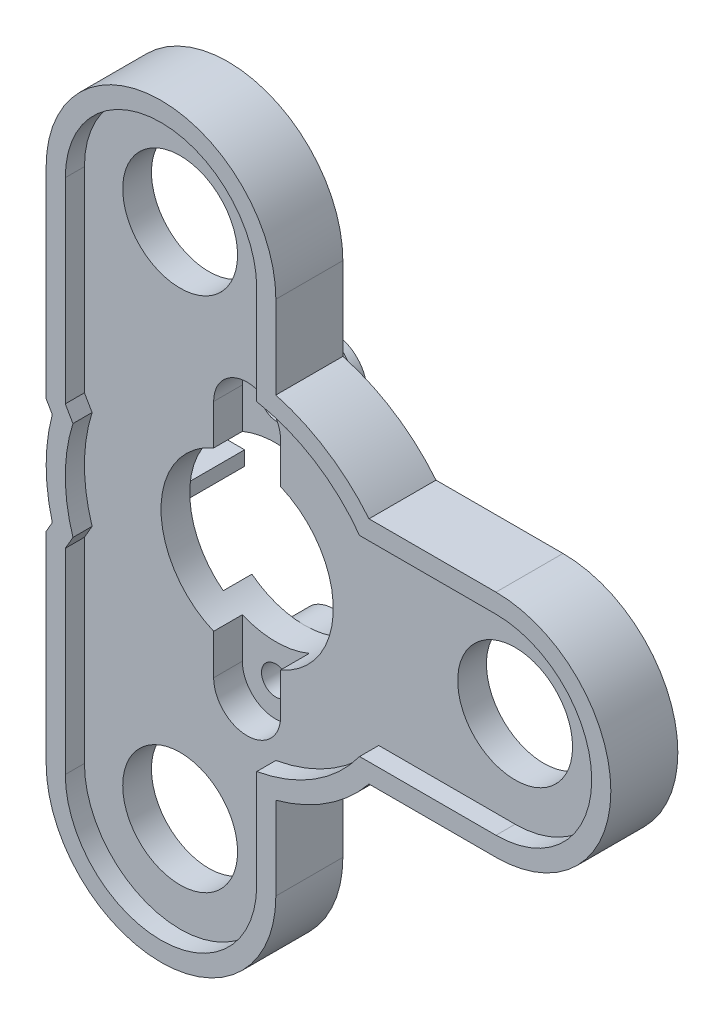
ISO-10303-21;
HEADER;
FILE_DESCRIPTION(('STEP AP214'),'2;1');
FILE_NAME('part.step','',(''),(''),'','','');
FILE_SCHEMA(('AUTOMOTIVE_DESIGN { 1 0 10303 214 1 1 1 1 }'));
ENDSEC;
DATA;
#1=APPLICATION_CONTEXT('core data for automotive mechanical design processes');
#2=APPLICATION_PROTOCOL_DEFINITION('international standard','automotive_design',2000,#1);
#3=PRODUCT_CONTEXT('',#1,'mechanical');
#4=PRODUCT('Part','Part','',(#3));
#5=PRODUCT_RELATED_PRODUCT_CATEGORY('part','',(#4));
#6=PRODUCT_DEFINITION_FORMATION('','',#4);
#7=PRODUCT_DEFINITION_CONTEXT('part definition',#1,'design');
#8=PRODUCT_DEFINITION('design','',#6,#7);
#9=PRODUCT_DEFINITION_SHAPE('','',#8);
#10=(LENGTH_UNIT() NAMED_UNIT(*) SI_UNIT(.MILLI.,.METRE.));
#11=(NAMED_UNIT(*) PLANE_ANGLE_UNIT() SI_UNIT($,.RADIAN.));
#12=(NAMED_UNIT(*) SI_UNIT($,.STERADIAN.) SOLID_ANGLE_UNIT());
#13=UNCERTAINTY_MEASURE_WITH_UNIT(LENGTH_MEASURE(1.E-05),#10,'distance_accuracy_value','');
#14=(GEOMETRIC_REPRESENTATION_CONTEXT(3) GLOBAL_UNCERTAINTY_ASSIGNED_CONTEXT((#13)) GLOBAL_UNIT_ASSIGNED_CONTEXT((#10,
#11,#12)) REPRESENTATION_CONTEXT('',''));
#15=CARTESIAN_POINT('',(0.,0.,0.));
#16=DIRECTION('',(0.,0.,1.));
#17=DIRECTION('',(1.,0.,0.));
#18=AXIS2_PLACEMENT_3D('',#15,#16,#17);
#19=CARTESIAN_POINT('',(0.,0.,-4.5));
#20=DIRECTION('',(0.,0.,1.));
#21=DIRECTION('',(1.,0.,0.));
#22=AXIS2_PLACEMENT_3D('',#19,#20,#21);
#23=PLANE('',#22);
#24=CARTESIAN_POINT('',(0.,0.,-4.5));
#25=DIRECTION('',(0.,0.,1.));
#26=DIRECTION('',(1.,0.,0.));
#27=AXIS2_PLACEMENT_3D('',#24,#25,#26);
#28=CIRCLE('',#27,9.);
#29=CARTESIAN_POINT('',(-5.5,-7.1239034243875,-4.5));
#30=VERTEX_POINT('',#29);
#31=CARTESIAN_POINT('',(0.,-9.,-4.5));
#32=VERTEX_POINT('',#31);
#33=EDGE_CURVE('E534',#30,#32,#28,.T.);
#34=ORIENTED_EDGE('',*,*,#33,.T.);
#35=CARTESIAN_POINT('',(0.,-12.5,-4.5));
#36=DIRECTION('',(0.,0.,-1.));
#37=DIRECTION('',(-1.,0.,0.));
#38=AXIS2_PLACEMENT_3D('',#35,#36,#37);
#39=CIRCLE('',#38,3.5);
#40=EDGE_CURVE('E537',#32,#32,#39,.T.);
#41=ORIENTED_EDGE('',*,*,#40,.F.);
#42=CARTESIAN_POINT('',(5.5,-7.1239034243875,-4.5));
#43=VERTEX_POINT('',#42);
#44=EDGE_CURVE('E544',#32,#43,#28,.T.);
#45=ORIENTED_EDGE('',*,*,#44,.T.);
#46=DIRECTION('',(0.,-1.,0.));
#47=VECTOR('',#46,1.);
#48=CARTESIAN_POINT('',(5.5,-14.,-4.5));
#49=LINE('',#48,#47);
#50=CARTESIAN_POINT('',(5.5,-14.,-4.5));
#51=VERTEX_POINT('',#50);
#52=EDGE_CURVE('E543',#43,#51,#49,.T.);
#53=ORIENTED_EDGE('',*,*,#52,.T.);
#54=CARTESIAN_POINT('',(0.,-14.,-4.5));
#55=DIRECTION('',(0.,0.,-1.));
#56=DIRECTION('',(1.,0.,0.));
#57=AXIS2_PLACEMENT_3D('',#54,#55,#56);
#58=CIRCLE('',#57,5.5);
#59=CARTESIAN_POINT('',(-5.5,-14.,-4.5));
#60=VERTEX_POINT('',#59);
#61=EDGE_CURVE('E557',#51,#60,#58,.T.);
#62=ORIENTED_EDGE('',*,*,#61,.T.);
#63=DIRECTION('',(0.,1.,0.));
#64=VECTOR('',#63,1.);
#65=CARTESIAN_POINT('',(-5.5,-14.,-4.5));
#66=LINE('',#65,#64);
#67=EDGE_CURVE('E539',#60,#30,#66,.T.);
#68=ORIENTED_EDGE('',*,*,#67,.T.);
#69=EDGE_LOOP('',(#34,#41,#45,#53,#62,#68));
#70=FACE_BOUND('',#69,.T.);
#71=ADVANCED_FACE('F31',(#70),#23,.F.);
#72=CARTESIAN_POINT('',(0.,0.,-4.5));
#73=DIRECTION('',(0.,0.,-1.));
#74=DIRECTION('',(-1.,0.,0.));
#75=AXIS2_PLACEMENT_3D('',#72,#73,#74);
#76=PLANE('',#75);
#77=CARTESIAN_POINT('',(0.,0.,-4.5));
#78=DIRECTION('',(0.,0.,1.));
#79=DIRECTION('',(-1.,0.,0.));
#80=AXIS2_PLACEMENT_3D('',#77,#78,#79);
#81=CIRCLE('',#80,9.);
#82=CARTESIAN_POINT('',(5.5,7.1239034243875,-4.5));
#83=VERTEX_POINT('',#82);
#84=CARTESIAN_POINT('',(0.,9.,-4.5));
#85=VERTEX_POINT('',#84);
#86=EDGE_CURVE('E591',#83,#85,#81,.T.);
#87=ORIENTED_EDGE('',*,*,#86,.T.);
#88=CARTESIAN_POINT('',(0.,12.5,-4.5));
#89=DIRECTION('',(0.,0.,-1.));
#90=DIRECTION('',(-1.,0.,0.));
#91=AXIS2_PLACEMENT_3D('',#88,#89,#90);
#92=CIRCLE('',#91,3.5);
#93=EDGE_CURVE('E44',#85,#85,#92,.T.);
#94=ORIENTED_EDGE('',*,*,#93,.F.);
#95=CARTESIAN_POINT('',(-5.5,7.1239034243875,-4.5));
#96=VERTEX_POINT('',#95);
#97=EDGE_CURVE('E590',#85,#96,#81,.T.);
#98=ORIENTED_EDGE('',*,*,#97,.T.);
#99=DIRECTION('',(0.,1.,0.));
#100=VECTOR('',#99,1.);
#101=CARTESIAN_POINT('',(-5.5,14.,-4.5));
#102=LINE('',#101,#100);
#103=CARTESIAN_POINT('',(-5.5,14.,-4.5));
#104=VERTEX_POINT('',#103);
#105=EDGE_CURVE('E594',#96,#104,#102,.T.);
#106=ORIENTED_EDGE('',*,*,#105,.T.);
#107=CARTESIAN_POINT('',(0.,14.,-4.5));
#108=DIRECTION('',(0.,0.,-1.));
#109=DIRECTION('',(-1.,0.,0.));
#110=AXIS2_PLACEMENT_3D('',#107,#108,#109);
#111=CIRCLE('',#110,5.5);
#112=CARTESIAN_POINT('',(5.5,14.,-4.5));
#113=VERTEX_POINT('',#112);
#114=EDGE_CURVE('E596',#104,#113,#111,.T.);
#115=ORIENTED_EDGE('',*,*,#114,.T.);
#116=DIRECTION('',(0.,-1.,0.));
#117=VECTOR('',#116,1.);
#118=CARTESIAN_POINT('',(5.5,14.,-4.5));
#119=LINE('',#118,#117);
#120=EDGE_CURVE('E598',#113,#83,#119,.T.);
#121=ORIENTED_EDGE('',*,*,#120,.T.);
#122=EDGE_LOOP('',(#87,#94,#98,#106,#115,#121));
#123=FACE_BOUND('',#122,.T.);
#124=ADVANCED_FACE('F1182',(#123),#76,.T.);
#125=CARTESIAN_POINT('',(0.,0.,-3.5));
#126=DIRECTION('',(0.,0.,1.));
#127=DIRECTION('',(1.,0.,0.));
#128=AXIS2_PLACEMENT_3D('',#125,#126,#127);
#129=PLANE('',#128);
#130=CARTESIAN_POINT('',(0.,0.,-3.5));
#131=DIRECTION('',(0.,0.,1.));
#132=DIRECTION('',(-1.,0.,0.));
#133=AXIS2_PLACEMENT_3D('',#130,#131,#132);
#134=CIRCLE('',#133,19.);
#135=CARTESIAN_POINT('',(16.9675425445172,-8.55,-3.5));
#136=VERTEX_POINT('',#135);
#137=CARTESIAN_POINT('',(16.9675425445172,8.55,-3.5));
#138=VERTEX_POINT('',#137);
#139=EDGE_CURVE('E791',#136,#138,#134,.T.);
#140=ORIENTED_EDGE('',*,*,#139,.F.);
#141=CARTESIAN_POINT('',(17.8605710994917,-9.,-3.5));
#142=DIRECTION('',(0.,0.,-1.));
#143=DIRECTION('',(1.,0.,0.));
#144=AXIS2_PLACEMENT_3D('',#141,#142,#143);
#145=CIRCLE('',#144,1.);
#146=CARTESIAN_POINT('',(17.8605710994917,-10.,-3.5));
#147=VERTEX_POINT('',#146);
#148=EDGE_CURVE('E789',#147,#136,#145,.T.);
#149=ORIENTED_EDGE('',*,*,#148,.F.);
#150=DIRECTION('',(-1.,0.,0.));
#151=VECTOR('',#150,1.);
#152=CARTESIAN_POINT('',(28.,-10.,-3.5));
#153=LINE('',#152,#151);
#154=CARTESIAN_POINT('',(28.,-10.,-3.5));
#155=VERTEX_POINT('',#154);
#156=EDGE_CURVE('E803',#155,#147,#153,.T.);
#157=ORIENTED_EDGE('',*,*,#156,.F.);
#158=CARTESIAN_POINT('',(28.,0.,-3.5));
#159=DIRECTION('',(0.,0.,-1.));
#160=DIRECTION('',(-1.,0.,0.));
#161=AXIS2_PLACEMENT_3D('',#158,#159,#160);
#162=CIRCLE('',#161,10.);
#163=CARTESIAN_POINT('',(28.,10.,-3.5));
#164=VERTEX_POINT('',#163);
#165=EDGE_CURVE('E800',#164,#155,#162,.T.);
#166=ORIENTED_EDGE('',*,*,#165,.F.);
#167=DIRECTION('',(1.,0.,0.));
#168=VECTOR('',#167,1.);
#169=CARTESIAN_POINT('',(17.8605710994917,10.,-3.5));
#170=LINE('',#169,#168);
#171=CARTESIAN_POINT('',(17.8605710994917,10.,-3.5));
#172=VERTEX_POINT('',#171);
#173=EDGE_CURVE('E797',#172,#164,#170,.T.);
#174=ORIENTED_EDGE('',*,*,#173,.F.);
#175=CARTESIAN_POINT('',(17.8605710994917,9.00000000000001,-3.5));
#176=DIRECTION('',(0.,0.,-1.));
#177=DIRECTION('',(1.,0.,0.));
#178=AXIS2_PLACEMENT_3D('',#175,#176,#177);
#179=CIRCLE('',#178,1.);
#180=EDGE_CURVE('E794',#138,#172,#179,.T.);
#181=ORIENTED_EDGE('',*,*,#180,.F.);
#182=EDGE_LOOP('',(#140,#149,#157,#166,#174,#181));
#183=FACE_BOUND('',#182,.T.);
#184=CARTESIAN_POINT('',(0.,0.,-3.5));
#185=DIRECTION('',(0.,0.,1.));
#186=DIRECTION('',(1.,0.,0.));
#187=AXIS2_PLACEMENT_3D('',#184,#185,#186);
#188=CIRCLE('',#187,19.);
#189=CARTESIAN_POINT('',(-18.3596971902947,4.8909630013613,-3.5));
#190=VERTEX_POINT('',#189);
#191=CARTESIAN_POINT('',(-18.3596971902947,-4.8909630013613,-3.5));
#192=VERTEX_POINT('',#191);
#193=EDGE_CURVE('E975',#190,#192,#188,.T.);
#194=ORIENTED_EDGE('',*,*,#193,.F.);
#195=DIRECTION('',(0.499999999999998,-0.86602540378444,0.));
#196=VECTOR('',#195,1.);
#197=CARTESIAN_POINT('',(-19.,6.,-3.5));
#198=LINE('',#197,#196);
#199=CARTESIAN_POINT('',(-19.,6.,-3.5));
#200=VERTEX_POINT('',#199);
#201=EDGE_CURVE('E1002',#200,#190,#198,.T.);
#202=ORIENTED_EDGE('',*,*,#201,.F.);
#203=DIRECTION('',(0.,-1.,0.));
#204=VECTOR('',#203,1.);
#205=CARTESIAN_POINT('',(-19.,27.,-3.5));
#206=LINE('',#205,#204);
#207=CARTESIAN_POINT('',(-19.,27.,-3.5));
#208=VERTEX_POINT('',#207);
#209=EDGE_CURVE('E1000',#208,#200,#206,.T.);
#210=ORIENTED_EDGE('',*,*,#209,.F.);
#211=CARTESIAN_POINT('',(-7.,27.,-3.5));
#212=DIRECTION('',(0.,0.,1.));
#213=DIRECTION('',(1.,0.,0.));
#214=AXIS2_PLACEMENT_3D('',#211,#212,#213);
#215=CIRCLE('',#214,12.);
#216=CARTESIAN_POINT('',(5.,27.,-3.5));
#217=VERTEX_POINT('',#216);
#218=EDGE_CURVE('E998',#217,#208,#215,.T.);
#219=ORIENTED_EDGE('',*,*,#218,.F.);
#220=DIRECTION('',(0.,1.,0.));
#221=VECTOR('',#220,1.);
#222=CARTESIAN_POINT('',(5.,27.,-3.5));
#223=LINE('',#222,#221);
#224=CARTESIAN_POINT('',(5.,18.3303027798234,-3.5));
#225=VERTEX_POINT('',#224);
#226=EDGE_CURVE('E996',#225,#217,#223,.T.);
#227=ORIENTED_EDGE('',*,*,#226,.F.);
#228=CARTESIAN_POINT('',(0.,0.,-3.5));
#229=DIRECTION('',(0.,0.,1.));
#230=DIRECTION('',(1.,0.,0.));
#231=AXIS2_PLACEMENT_3D('',#228,#229,#230);
#232=CIRCLE('',#231,19.);
#233=CARTESIAN_POINT('',(14.7309198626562,12.,-3.5));
#234=VERTEX_POINT('',#233);
#235=EDGE_CURVE('E994',#234,#225,#232,.T.);
#236=ORIENTED_EDGE('',*,*,#235,.F.);
#237=DIRECTION('',(-1.,0.,0.));
#238=VECTOR('',#237,1.);
#239=CARTESIAN_POINT('',(28.,12.,-3.5));
#240=LINE('',#239,#238);
#241=CARTESIAN_POINT('',(28.,12.,-3.5));
#242=VERTEX_POINT('',#241);
#243=EDGE_CURVE('E992',#242,#234,#240,.T.);
#244=ORIENTED_EDGE('',*,*,#243,.F.);
#245=CARTESIAN_POINT('',(28.,0.,-3.5));
#246=DIRECTION('',(0.,0.,1.));
#247=DIRECTION('',(1.,0.,0.));
#248=AXIS2_PLACEMENT_3D('',#245,#246,#247);
#249=CIRCLE('',#248,12.);
#250=CARTESIAN_POINT('',(28.,-12.,-3.5));
#251=VERTEX_POINT('',#250);
#252=EDGE_CURVE('E990',#251,#242,#249,.T.);
#253=ORIENTED_EDGE('',*,*,#252,.F.);
#254=DIRECTION('',(1.,0.,0.));
#255=VECTOR('',#254,1.);
#256=CARTESIAN_POINT('',(28.,-12.,-3.5));
#257=LINE('',#256,#255);
#258=CARTESIAN_POINT('',(14.7309198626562,-12.,-3.5));
#259=VERTEX_POINT('',#258);
#260=EDGE_CURVE('E988',#259,#251,#257,.T.);
#261=ORIENTED_EDGE('',*,*,#260,.F.);
#262=CARTESIAN_POINT('',(0.,0.,-3.5));
#263=DIRECTION('',(0.,0.,1.));
#264=DIRECTION('',(-1.,0.,0.));
#265=AXIS2_PLACEMENT_3D('',#262,#263,#264);
#266=CIRCLE('',#265,19.);
#267=CARTESIAN_POINT('',(5.,-18.3303027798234,-3.5));
#268=VERTEX_POINT('',#267);
#269=EDGE_CURVE('E986',#268,#259,#266,.T.);
#270=ORIENTED_EDGE('',*,*,#269,.F.);
#271=DIRECTION('',(0.,1.,0.));
#272=VECTOR('',#271,1.);
#273=CARTESIAN_POINT('',(5.,-27.,-3.5));
#274=LINE('',#273,#272);
#275=CARTESIAN_POINT('',(5.,-27.,-3.5));
#276=VERTEX_POINT('',#275);
#277=EDGE_CURVE('E984',#276,#268,#274,.T.);
#278=ORIENTED_EDGE('',*,*,#277,.F.);
#279=CARTESIAN_POINT('',(-7.,-27.,-3.5));
#280=DIRECTION('',(0.,0.,1.));
#281=DIRECTION('',(-1.,0.,0.));
#282=AXIS2_PLACEMENT_3D('',#279,#280,#281);
#283=CIRCLE('',#282,12.);
#284=CARTESIAN_POINT('',(-19.,-27.,-3.5));
#285=VERTEX_POINT('',#284);
#286=EDGE_CURVE('E982',#285,#276,#283,.T.);
#287=ORIENTED_EDGE('',*,*,#286,.F.);
#288=DIRECTION('',(0.,-1.,0.));
#289=VECTOR('',#288,1.);
#290=CARTESIAN_POINT('',(-19.,-27.,-3.5));
#291=LINE('',#290,#289);
#292=CARTESIAN_POINT('',(-19.,-6.,-3.5));
#293=VERTEX_POINT('',#292);
#294=EDGE_CURVE('E980',#293,#285,#291,.T.);
#295=ORIENTED_EDGE('',*,*,#294,.F.);
#296=DIRECTION('',(-0.499999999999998,-0.86602540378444,0.));
#297=VECTOR('',#296,1.);
#298=CARTESIAN_POINT('',(-19.,-6.,-3.5));
#299=LINE('',#298,#297);
#300=EDGE_CURVE('E978',#192,#293,#299,.T.);
#301=ORIENTED_EDGE('',*,*,#300,.F.);
#302=EDGE_LOOP('',(#194,#202,#210,#219,#227,#236,#244,#253,#261,#270,#278,#287,#295,#301));
#303=FACE_BOUND('',#302,.T.);
#304=CARTESIAN_POINT('',(0.,-14.,-3.5));
#305=DIRECTION('',(0.,0.,1.));
#306=DIRECTION('',(1.,0.,0.));
#307=AXIS2_PLACEMENT_3D('',#304,#305,#306);
#308=CIRCLE('',#307,5.5);
#309=CARTESIAN_POINT('',(5.02270831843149,-16.2410714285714,-3.5));
#310=VERTEX_POINT('',#309);
#311=CARTESIAN_POINT('',(2.36132354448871,-18.9673082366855,-3.5));
#312=VERTEX_POINT('',#311);
#313=EDGE_CURVE('E574',#310,#312,#308,.F.);
#314=ORIENTED_EDGE('',*,*,#313,.F.);
#315=CARTESIAN_POINT('',(0.,0.,-3.5));
#316=DIRECTION('',(0.,0.,-1.));
#317=DIRECTION('',(-1.,0.,0.));
#318=AXIS2_PLACEMENT_3D('',#315,#316,#317);
#319=CIRCLE('',#318,17.);
#320=CARTESIAN_POINT('',(16.9834478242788,-0.750000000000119,-3.5));
#321=VERTEX_POINT('',#320);
#322=EDGE_CURVE('E844',#321,#310,#319,.T.);
#323=ORIENTED_EDGE('',*,*,#322,.F.);
#324=DIRECTION('',(-1.,0.,0.));
#325=VECTOR('',#324,1.);
#326=CARTESIAN_POINT('',(0.,-0.75,-3.5));
#327=LINE('',#326,#325);
#328=CARTESIAN_POINT('',(17.1394208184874,-0.75000000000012,-3.5));
#329=VERTEX_POINT('',#328);
#330=EDGE_CURVE('E656',#329,#321,#327,.T.);
#331=ORIENTED_EDGE('',*,*,#330,.F.);
#332=DIRECTION('',(0.,-1.,0.));
#333=VECTOR('',#332,1.);
#334=CARTESIAN_POINT('',(17.1394208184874,-1.19684005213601E-13,-3.5));
#335=LINE('',#334,#333);
#336=CARTESIAN_POINT('',(17.1394208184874,0.74999999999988,-3.5));
#337=VERTEX_POINT('',#336);
#338=EDGE_CURVE('E1092',#337,#329,#335,.T.);
#339=ORIENTED_EDGE('',*,*,#338,.F.);
#340=DIRECTION('',(1.,0.,0.));
#341=VECTOR('',#340,1.);
#342=CARTESIAN_POINT('',(0.,0.75,-3.5));
#343=LINE('',#342,#341);
#344=CARTESIAN_POINT('',(16.9834478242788,0.749999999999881,-3.5));
#345=VERTEX_POINT('',#344);
#346=EDGE_CURVE('E661',#345,#337,#343,.T.);
#347=ORIENTED_EDGE('',*,*,#346,.F.);
#348=CARTESIAN_POINT('',(5.02270831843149,16.2410714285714,-3.5));
#349=VERTEX_POINT('',#348);
#350=EDGE_CURVE('E842',#349,#345,#319,.T.);
#351=ORIENTED_EDGE('',*,*,#350,.F.);
#352=CARTESIAN_POINT('',(0.,14.,-3.5));
#353=DIRECTION('',(0.,0.,1.));
#354=DIRECTION('',(1.,0.,0.));
#355=AXIS2_PLACEMENT_3D('',#352,#353,#354);
#356=CIRCLE('',#355,5.5);
#357=CARTESIAN_POINT('',(2.36132354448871,18.9673082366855,-3.5));
#358=VERTEX_POINT('',#357);
#359=EDGE_CURVE('E619',#358,#349,#356,.F.);
#360=ORIENTED_EDGE('',*,*,#359,.F.);
#361=CARTESIAN_POINT('',(2.,19.8997487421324,-3.5));
#362=DIRECTION('',(0.,0.,-1.));
#363=DIRECTION('',(1.,0.,0.));
#364=AXIS2_PLACEMENT_3D('',#361,#362,#363);
#365=CIRCLE('',#364,1.);
#366=CARTESIAN_POINT('',(3.,19.8997487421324,-3.5));
#367=VERTEX_POINT('',#366);
#368=EDGE_CURVE('E744',#367,#358,#365,.T.);
#369=ORIENTED_EDGE('',*,*,#368,.F.);
#370=DIRECTION('',(0.,-1.,0.));
#371=VECTOR('',#370,1.);
#372=CARTESIAN_POINT('',(3.,27.,-3.5));
#373=LINE('',#372,#371);
#374=CARTESIAN_POINT('',(3.,27.,-3.5));
#375=VERTEX_POINT('',#374);
#376=EDGE_CURVE('E758',#375,#367,#373,.T.);
#377=ORIENTED_EDGE('',*,*,#376,.F.);
#378=CARTESIAN_POINT('',(-7.,27.,-3.5));
#379=DIRECTION('',(0.,0.,-1.));
#380=DIRECTION('',(-1.,0.,0.));
#381=AXIS2_PLACEMENT_3D('',#378,#379,#380);
#382=CIRCLE('',#381,10.);
#383=CARTESIAN_POINT('',(-17.,27.,-3.5));
#384=VERTEX_POINT('',#383);
#385=EDGE_CURVE('E755',#384,#375,#382,.T.);
#386=ORIENTED_EDGE('',*,*,#385,.F.);
#387=DIRECTION('',(0.,1.,0.));
#388=VECTOR('',#387,1.);
#389=CARTESIAN_POINT('',(-17.,12.,-3.5));
#390=LINE('',#389,#388);
#391=CARTESIAN_POINT('',(-17.,12.,-3.5));
#392=VERTEX_POINT('',#391);
#393=EDGE_CURVE('E752',#392,#384,#390,.T.);
#394=ORIENTED_EDGE('',*,*,#393,.F.);
#395=CARTESIAN_POINT('',(-16.,12.,-3.5));
#396=DIRECTION('',(0.,0.,-1.));
#397=DIRECTION('',(1.,0.,0.));
#398=AXIS2_PLACEMENT_3D('',#395,#396,#397);
#399=CIRCLE('',#398,1.);
#400=CARTESIAN_POINT('',(-15.2,11.4,-3.5));
#401=VERTEX_POINT('',#400);
#402=EDGE_CURVE('E749',#401,#392,#399,.T.);
#403=ORIENTED_EDGE('',*,*,#402,.F.);
#404=CARTESIAN_POINT('',(0.,0.,-3.5));
#405=DIRECTION('',(0.,0.,1.));
#406=DIRECTION('',(-1.,0.,0.));
#407=AXIS2_PLACEMENT_3D('',#404,#405,#406);
#408=CIRCLE('',#407,19.);
#409=CARTESIAN_POINT('',(-2.66267605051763,18.8125,-3.5));
#410=VERTEX_POINT('',#409);
#411=EDGE_CURVE('E747',#410,#401,#408,.T.);
#412=ORIENTED_EDGE('',*,*,#411,.F.);
#413=CARTESIAN_POINT('',(-5.02270831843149,16.2410714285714,-3.5));
#414=VERTEX_POINT('',#413);
#415=EDGE_CURVE('E615',#414,#410,#356,.F.);
#416=ORIENTED_EDGE('',*,*,#415,.F.);
#417=CARTESIAN_POINT('',(-16.9834478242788,0.75,-3.5));
#418=VERTEX_POINT('',#417);
#419=EDGE_CURVE('E838',#418,#414,#319,.T.);
#420=ORIENTED_EDGE('',*,*,#419,.F.);
#421=DIRECTION('',(1.,0.,0.));
#422=VECTOR('',#421,1.);
#423=CARTESIAN_POINT('',(0.,0.75,-3.5));
#424=LINE('',#423,#422);
#425=CARTESIAN_POINT('',(-17.1394208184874,0.75,-3.5));
#426=VERTEX_POINT('',#425);
#427=EDGE_CURVE('E691',#426,#418,#424,.T.);
#428=ORIENTED_EDGE('',*,*,#427,.F.);
#429=DIRECTION('',(0.,1.,0.));
#430=VECTOR('',#429,1.);
#431=CARTESIAN_POINT('',(-17.1394208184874,0.,-3.5));
#432=LINE('',#431,#430);
#433=CARTESIAN_POINT('',(-17.1394208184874,-0.75,-3.5));
#434=VERTEX_POINT('',#433);
#435=EDGE_CURVE('E1087',#434,#426,#432,.T.);
#436=ORIENTED_EDGE('',*,*,#435,.F.);
#437=DIRECTION('',(-1.,0.,0.));
#438=VECTOR('',#437,1.);
#439=CARTESIAN_POINT('',(0.,-0.75,-3.5));
#440=LINE('',#439,#438);
#441=CARTESIAN_POINT('',(-16.9834478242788,-0.75,-3.5));
#442=VERTEX_POINT('',#441);
#443=EDGE_CURVE('E696',#442,#434,#440,.T.);
#444=ORIENTED_EDGE('',*,*,#443,.F.);
#445=CARTESIAN_POINT('',(-5.02270831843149,-16.2410714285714,-3.5));
#446=VERTEX_POINT('',#445);
#447=EDGE_CURVE('E843',#446,#442,#319,.T.);
#448=ORIENTED_EDGE('',*,*,#447,.F.);
#449=CARTESIAN_POINT('',(-2.66267605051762,-18.8125,-3.5));
#450=VERTEX_POINT('',#449);
#451=EDGE_CURVE('E571',#450,#446,#308,.F.);
#452=ORIENTED_EDGE('',*,*,#451,.F.);
#453=CARTESIAN_POINT('',(0.,0.,-3.5));
#454=DIRECTION('',(0.,0.,1.));
#455=DIRECTION('',(-1.,0.,0.));
#456=AXIS2_PLACEMENT_3D('',#453,#454,#455);
#457=CIRCLE('',#456,19.);
#458=CARTESIAN_POINT('',(-15.2,-11.4,-3.5));
#459=VERTEX_POINT('',#458);
#460=EDGE_CURVE('E700',#459,#450,#457,.T.);
#461=ORIENTED_EDGE('',*,*,#460,.F.);
#462=CARTESIAN_POINT('',(-16.,-12.,-3.5));
#463=DIRECTION('',(0.,0.,-1.));
#464=DIRECTION('',(-1.,0.,0.));
#465=AXIS2_PLACEMENT_3D('',#462,#463,#464);
#466=CIRCLE('',#465,0.999999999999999);
#467=CARTESIAN_POINT('',(-17.,-12.,-3.5));
#468=VERTEX_POINT('',#467);
#469=EDGE_CURVE('E698',#468,#459,#466,.T.);
#470=ORIENTED_EDGE('',*,*,#469,.F.);
#471=DIRECTION('',(0.,1.,0.));
#472=VECTOR('',#471,1.);
#473=CARTESIAN_POINT('',(-17.,-27.,-3.5));
#474=LINE('',#473,#472);
#475=CARTESIAN_POINT('',(-17.,-27.,-3.5));
#476=VERTEX_POINT('',#475);
#477=EDGE_CURVE('E711',#476,#468,#474,.T.);
#478=ORIENTED_EDGE('',*,*,#477,.F.);
#479=CARTESIAN_POINT('',(-7.,-27.,-3.5));
#480=DIRECTION('',(0.,0.,-1.));
#481=DIRECTION('',(-1.,0.,0.));
#482=AXIS2_PLACEMENT_3D('',#479,#480,#481);
#483=CIRCLE('',#482,10.);
#484=CARTESIAN_POINT('',(3.00000000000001,-27.,-3.5));
#485=VERTEX_POINT('',#484);
#486=EDGE_CURVE('E708',#485,#476,#483,.T.);
#487=ORIENTED_EDGE('',*,*,#486,.F.);
#488=DIRECTION('',(0.,-1.,0.));
#489=VECTOR('',#488,1.);
#490=CARTESIAN_POINT('',(3.,-19.8997487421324,-3.5));
#491=LINE('',#490,#489);
#492=CARTESIAN_POINT('',(3.,-19.8997487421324,-3.5));
#493=VERTEX_POINT('',#492);
#494=EDGE_CURVE('E705',#493,#485,#491,.T.);
#495=ORIENTED_EDGE('',*,*,#494,.F.);
#496=CARTESIAN_POINT('',(2.,-19.8997487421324,-3.5));
#497=DIRECTION('',(0.,0.,-1.));
#498=DIRECTION('',(1.,0.,0.));
#499=AXIS2_PLACEMENT_3D('',#496,#497,#498);
#500=CIRCLE('',#499,0.999999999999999);
#501=EDGE_CURVE('E703',#312,#493,#500,.T.);
#502=ORIENTED_EDGE('',*,*,#501,.F.);
#503=EDGE_LOOP('',(#314,#323,#331,#339,#347,#351,#360,#369,#377,#386,#394,#403,#412,#416,#420,
#428,#436,#444,#448,#452,#461,#470,#478,#487,#495,#502));
#504=FACE_BOUND('',#503,.T.);
#505=ADVANCED_FACE('F1231',(#183,#303,#504),#129,.F.);
#506=CARTESIAN_POINT('',(0.,0.,-1.5));
#507=DIRECTION('',(0.,0.,-1.));
#508=DIRECTION('',(-1.,0.,0.));
#509=AXIS2_PLACEMENT_3D('',#506,#507,#508);
#510=PLANE('',#509);
#511=CARTESIAN_POINT('',(0.,-14.,-1.5));
#512=DIRECTION('',(0.,0.,-1.));
#513=DIRECTION('',(1.,0.,0.));
#514=AXIS2_PLACEMENT_3D('',#511,#512,#513);
#515=CIRCLE('',#514,5.5);
#516=CARTESIAN_POINT('',(5.5,-14.,-1.5));
#517=VERTEX_POINT('',#516);
#518=CARTESIAN_POINT('',(5.02270831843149,-16.2410714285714,-1.5));
#519=VERTEX_POINT('',#518);
#520=EDGE_CURVE('E552',#517,#519,#515,.T.);
#521=ORIENTED_EDGE('',*,*,#520,.F.);
#522=DIRECTION('',(0.,-1.,0.));
#523=VECTOR('',#522,1.);
#524=CARTESIAN_POINT('',(5.5,-14.,-1.5));
#525=LINE('',#524,#523);
#526=CARTESIAN_POINT('',(5.5,-7.1239034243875,-1.5));
#527=VERTEX_POINT('',#526);
#528=EDGE_CURVE('E1155',#527,#517,#525,.T.);
#529=ORIENTED_EDGE('',*,*,#528,.F.);
#530=CARTESIAN_POINT('',(0.,0.,-1.5));
#531=DIRECTION('',(0.,0.,-1.));
#532=DIRECTION('',(-1.,0.,0.));
#533=AXIS2_PLACEMENT_3D('',#530,#531,#532);
#534=CIRCLE('',#533,9.);
#535=CARTESIAN_POINT('',(5.5,7.1239034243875,-1.5));
#536=VERTEX_POINT('',#535);
#537=EDGE_CURVE('E854',#536,#527,#534,.T.);
#538=ORIENTED_EDGE('',*,*,#537,.F.);
#539=DIRECTION('',(0.,-1.,0.));
#540=VECTOR('',#539,1.);
#541=CARTESIAN_POINT('',(5.5,14.,-1.5));
#542=LINE('',#541,#540);
#543=CARTESIAN_POINT('',(5.5,14.,-1.5));
#544=VERTEX_POINT('',#543);
#545=EDGE_CURVE('E587',#544,#536,#542,.T.);
#546=ORIENTED_EDGE('',*,*,#545,.F.);
#547=CARTESIAN_POINT('',(0.,14.,-1.5));
#548=DIRECTION('',(0.,0.,-1.));
#549=DIRECTION('',(-1.,0.,0.));
#550=AXIS2_PLACEMENT_3D('',#547,#548,#549);
#551=CIRCLE('',#550,5.5);
#552=CARTESIAN_POINT('',(5.02270831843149,16.2410714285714,-1.5));
#553=VERTEX_POINT('',#552);
#554=EDGE_CURVE('E583',#553,#544,#551,.T.);
#555=ORIENTED_EDGE('',*,*,#554,.F.);
#556=CARTESIAN_POINT('',(0.,0.,-1.5));
#557=DIRECTION('',(0.,0.,-1.));
#558=DIRECTION('',(-1.,0.,0.));
#559=AXIS2_PLACEMENT_3D('',#556,#557,#558);
#560=CIRCLE('',#559,17.);
#561=CARTESIAN_POINT('',(16.9834478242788,0.749999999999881,-1.5));
#562=VERTEX_POINT('',#561);
#563=EDGE_CURVE('E849',#553,#562,#560,.T.);
#564=ORIENTED_EDGE('',*,*,#563,.T.);
#565=DIRECTION('',(1.,0.,0.));
#566=VECTOR('',#565,1.);
#567=CARTESIAN_POINT('',(9.26225070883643,0.749999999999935,-1.5));
#568=LINE('',#567,#566);
#569=CARTESIAN_POINT('',(9.26225070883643,0.749999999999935,-1.5));
#570=VERTEX_POINT('',#569);
#571=EDGE_CURVE('E631',#570,#562,#568,.T.);
#572=ORIENTED_EDGE('',*,*,#571,.F.);
#573=DIRECTION('',(0.,1.,0.));
#574=VECTOR('',#573,1.);
#575=CARTESIAN_POINT('',(9.26225070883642,-0.750000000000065,-1.5));
#576=LINE('',#575,#574);
#577=CARTESIAN_POINT('',(9.26225070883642,-0.750000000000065,-1.5));
#578=VERTEX_POINT('',#577);
#579=EDGE_CURVE('E628',#578,#570,#576,.T.);
#580=ORIENTED_EDGE('',*,*,#579,.F.);
#581=DIRECTION('',(1.,0.,0.));
#582=VECTOR('',#581,1.);
#583=CARTESIAN_POINT('',(0.,-0.75,-1.5));
#584=LINE('',#583,#582);
#585=CARTESIAN_POINT('',(16.9834478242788,-0.750000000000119,-1.5));
#586=VERTEX_POINT('',#585);
#587=EDGE_CURVE('E1089',#578,#586,#584,.T.);
#588=ORIENTED_EDGE('',*,*,#587,.T.);
#589=EDGE_CURVE('E850',#586,#519,#560,.T.);
#590=ORIENTED_EDGE('',*,*,#589,.T.);
#591=EDGE_LOOP('',(#521,#529,#538,#546,#555,#564,#572,#580,#588,#590));
#592=FACE_BOUND('',#591,.T.);
#593=ADVANCED_FACE('F1382',(#592),#510,.T.);
#594=DIRECTION('',(0.,1.,0.));
#595=VECTOR('',#594,1.);
#596=CARTESIAN_POINT('',(-5.5,-14.,-1.5));
#597=LINE('',#596,#595);
#598=CARTESIAN_POINT('',(-5.5,-14.,-1.5));
#599=VERTEX_POINT('',#598);
#600=CARTESIAN_POINT('',(-5.5,-7.1239034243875,-1.5));
#601=VERTEX_POINT('',#600);
#602=EDGE_CURVE('E551',#599,#601,#597,.T.);
#603=ORIENTED_EDGE('',*,*,#602,.F.);
#604=CARTESIAN_POINT('',(-5.02270831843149,-16.2410714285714,-1.5));
#605=VERTEX_POINT('',#604);
#606=EDGE_CURVE('E1156',#605,#599,#515,.T.);
#607=ORIENTED_EDGE('',*,*,#606,.F.);
#608=CARTESIAN_POINT('',(-16.9834478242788,-0.75,-1.5));
#609=VERTEX_POINT('',#608);
#610=EDGE_CURVE('E841',#605,#609,#560,.T.);
#611=ORIENTED_EDGE('',*,*,#610,.T.);
#612=DIRECTION('',(-1.,0.,0.));
#613=VECTOR('',#612,1.);
#614=CARTESIAN_POINT('',(-9.26225070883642,-0.75,-1.5));
#615=LINE('',#614,#613);
#616=CARTESIAN_POINT('',(-9.26225070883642,-0.75,-1.5));
#617=VERTEX_POINT('',#616);
#618=EDGE_CURVE('E666',#617,#609,#615,.T.);
#619=ORIENTED_EDGE('',*,*,#618,.F.);
#620=DIRECTION('',(0.,-1.,0.));
#621=VECTOR('',#620,1.);
#622=CARTESIAN_POINT('',(-9.26225070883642,0.75,-1.5));
#623=LINE('',#622,#621);
#624=CARTESIAN_POINT('',(-9.26225070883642,0.75,-1.5));
#625=VERTEX_POINT('',#624);
#626=EDGE_CURVE('E663',#625,#617,#623,.T.);
#627=ORIENTED_EDGE('',*,*,#626,.F.);
#628=DIRECTION('',(-1.,0.,0.));
#629=VECTOR('',#628,1.);
#630=CARTESIAN_POINT('',(0.,0.75,-1.5));
#631=LINE('',#630,#629);
#632=CARTESIAN_POINT('',(-16.9834478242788,0.75,-1.5));
#633=VERTEX_POINT('',#632);
#634=EDGE_CURVE('E1075',#625,#633,#631,.T.);
#635=ORIENTED_EDGE('',*,*,#634,.T.);
#636=CARTESIAN_POINT('',(-5.02270831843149,16.2410714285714,-1.5));
#637=VERTEX_POINT('',#636);
#638=EDGE_CURVE('E845',#633,#637,#560,.T.);
#639=ORIENTED_EDGE('',*,*,#638,.T.);
#640=CARTESIAN_POINT('',(-5.5,14.,-1.5));
#641=VERTEX_POINT('',#640);
#642=EDGE_CURVE('E584',#641,#637,#551,.T.);
#643=ORIENTED_EDGE('',*,*,#642,.F.);
#644=DIRECTION('',(0.,1.,0.));
#645=VECTOR('',#644,1.);
#646=CARTESIAN_POINT('',(-5.5,14.,-1.5));
#647=LINE('',#646,#645);
#648=CARTESIAN_POINT('',(-5.5,7.1239034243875,-1.5));
#649=VERTEX_POINT('',#648);
#650=EDGE_CURVE('E580',#649,#641,#647,.T.);
#651=ORIENTED_EDGE('',*,*,#650,.F.);
#652=EDGE_CURVE('E848',#601,#649,#534,.T.);
#653=ORIENTED_EDGE('',*,*,#652,.F.);
#654=EDGE_LOOP('',(#603,#607,#611,#619,#627,#635,#639,#643,#651,#653));
#655=FACE_BOUND('',#654,.T.);
#656=ADVANCED_FACE('F1171',(#655),#510,.T.);
#657=CARTESIAN_POINT('',(0.,0.,-1.5));
#658=DIRECTION('',(0.,0.,-1.));
#659=DIRECTION('',(-1.,0.,0.));
#660=AXIS2_PLACEMENT_3D('',#657,#658,#659);
#661=CYLINDRICAL_SURFACE('',#660,17.);
#662=DIRECTION('',(0.,0.,1.));
#663=VECTOR('',#662,1.);
#664=CARTESIAN_POINT('',(-5.02270831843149,-16.2410714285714,-3.));
#665=LINE('',#664,#663);
#666=EDGE_CURVE('E573',#446,#605,#665,.T.);
#667=ORIENTED_EDGE('',*,*,#666,.F.);
#668=ORIENTED_EDGE('',*,*,#447,.T.);
#669=DIRECTION('',(0.,0.,-1.));
#670=VECTOR('',#669,1.);
#671=CARTESIAN_POINT('',(-16.9834478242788,-0.75,-1.5));
#672=LINE('',#671,#670);
#673=EDGE_CURVE('E693',#609,#442,#672,.T.);
#674=ORIENTED_EDGE('',*,*,#673,.F.);
#675=ORIENTED_EDGE('',*,*,#610,.F.);
#676=EDGE_LOOP('',(#667,#668,#674,#675));
#677=FACE_BOUND('',#676,.T.);
#678=ADVANCED_FACE('F1389',(#677),#661,.F.);
#679=DIRECTION('',(0.,0.,1.));
#680=VECTOR('',#679,1.);
#681=CARTESIAN_POINT('',(5.02270831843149,-16.2410714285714,-3.));
#682=LINE('',#681,#680);
#683=EDGE_CURVE('E578',#519,#310,#682,.F.);
#684=ORIENTED_EDGE('',*,*,#683,.F.);
#685=ORIENTED_EDGE('',*,*,#589,.F.);
#686=DIRECTION('',(0.,0.,-1.));
#687=VECTOR('',#686,1.);
#688=CARTESIAN_POINT('',(16.9834478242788,-0.750000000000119,-1.5));
#689=LINE('',#688,#687);
#690=EDGE_CURVE('E654',#321,#586,#689,.F.);
#691=ORIENTED_EDGE('',*,*,#690,.F.);
#692=ORIENTED_EDGE('',*,*,#322,.T.);
#693=EDGE_LOOP('',(#684,#685,#691,#692));
#694=FACE_BOUND('',#693,.T.);
#695=ADVANCED_FACE('F1316',(#694),#661,.F.);
#696=CARTESIAN_POINT('',(2.,-19.8997487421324,-1.5));
#697=DIRECTION('',(0.,0.,-1.));
#698=DIRECTION('',(-1.,0.,0.));
#699=AXIS2_PLACEMENT_3D('',#696,#697,#698);
#700=CYLINDRICAL_SURFACE('',#699,0.999999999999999);
#701=DIRECTION('',(0.,0.,1.));
#702=VECTOR('',#701,1.);
#703=CARTESIAN_POINT('',(2.36132354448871,-18.9673082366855,-3.));
#704=LINE('',#703,#702);
#705=CARTESIAN_POINT('',(2.36132354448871,-18.9673082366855,-1.5));
#706=VERTEX_POINT('',#705);
#707=EDGE_CURVE('E576',#312,#706,#704,.T.);
#708=ORIENTED_EDGE('',*,*,#707,.F.);
#709=ORIENTED_EDGE('',*,*,#501,.T.);
#710=DIRECTION('',(0.,0.,-1.));
#711=VECTOR('',#710,1.);
#712=CARTESIAN_POINT('',(3.,-19.8997487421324,-1.5));
#713=LINE('',#712,#711);
#714=CARTESIAN_POINT('',(3.,-19.8997487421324,-1.5));
#715=VERTEX_POINT('',#714);
#716=EDGE_CURVE('E739',#715,#493,#713,.T.);
#717=ORIENTED_EDGE('',*,*,#716,.F.);
#718=CARTESIAN_POINT('',(2.,-19.8997487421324,-1.5));
#719=DIRECTION('',(0.,0.,-1.));
#720=DIRECTION('',(1.,0.,0.));
#721=AXIS2_PLACEMENT_3D('',#718,#719,#720);
#722=CIRCLE('',#721,0.999999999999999);
#723=EDGE_CURVE('E720',#706,#715,#722,.T.);
#724=ORIENTED_EDGE('',*,*,#723,.F.);
#725=EDGE_LOOP('',(#708,#709,#717,#724));
#726=FACE_BOUND('',#725,.T.);
#727=ADVANCED_FACE('F1313',(#726),#700,.F.);
#728=CARTESIAN_POINT('',(0.,0.,-1.5));
#729=DIRECTION('',(0.,0.,-1.));
#730=DIRECTION('',(-1.,0.,0.));
#731=AXIS2_PLACEMENT_3D('',#728,#729,#730);
#732=CYLINDRICAL_SURFACE('',#731,19.);
#733=DIRECTION('',(0.,0.,1.));
#734=VECTOR('',#733,1.);
#735=CARTESIAN_POINT('',(-2.66267605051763,-18.8125,-3.));
#736=LINE('',#735,#734);
#737=CARTESIAN_POINT('',(-2.66267605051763,-18.8125,-1.5));
#738=VERTEX_POINT('',#737);
#739=EDGE_CURVE('E569',#738,#450,#736,.F.);
#740=ORIENTED_EDGE('',*,*,#739,.F.);
#741=CARTESIAN_POINT('',(0.,0.,-1.5));
#742=DIRECTION('',(0.,0.,1.));
#743=DIRECTION('',(-1.,0.,0.));
#744=AXIS2_PLACEMENT_3D('',#741,#742,#743);
#745=CIRCLE('',#744,19.);
#746=CARTESIAN_POINT('',(-15.2,-11.4,-1.5));
#747=VERTEX_POINT('',#746);
#748=EDGE_CURVE('E717',#747,#738,#745,.T.);
#749=ORIENTED_EDGE('',*,*,#748,.F.);
#750=DIRECTION('',(0.,0.,-1.));
#751=VECTOR('',#750,1.);
#752=CARTESIAN_POINT('',(-15.2,-11.4,-1.5));
#753=LINE('',#752,#751);
#754=EDGE_CURVE('E731',#747,#459,#753,.T.);
#755=ORIENTED_EDGE('',*,*,#754,.T.);
#756=ORIENTED_EDGE('',*,*,#460,.T.);
#757=EDGE_LOOP('',(#740,#749,#755,#756));
#758=FACE_BOUND('',#757,.T.);
#759=ADVANCED_FACE('F1299',(#758),#732,.T.);
#760=CARTESIAN_POINT('',(-16.,-12.,-1.5));
#761=DIRECTION('',(0.,0.,-1.));
#762=DIRECTION('',(-1.,0.,0.));
#763=AXIS2_PLACEMENT_3D('',#760,#761,#762);
#764=PLANE('',#763);
#765=CARTESIAN_POINT('',(-7.,-27.,-1.5));
#766=DIRECTION('',(0.,0.,-1.));
#767=DIRECTION('',(-1.,0.,0.));
#768=AXIS2_PLACEMENT_3D('',#765,#766,#767);
#769=CIRCLE('',#768,6.);
#770=CARTESIAN_POINT('',(-13.,-27.,-1.5));
#771=VERTEX_POINT('',#770);
#772=EDGE_CURVE('E734',#771,#771,#769,.T.);
#773=ORIENTED_EDGE('',*,*,#772,.F.);
#774=EDGE_LOOP('',(#773));
#775=FACE_BOUND('',#774,.T.);
#776=ORIENTED_EDGE('',*,*,#748,.T.);
#777=CARTESIAN_POINT('',(0.,-14.,-1.5));
#778=DIRECTION('',(0.,0.,-1.));
#779=DIRECTION('',(-1.,0.,0.));
#780=AXIS2_PLACEMENT_3D('',#777,#778,#779);
#781=CIRCLE('',#780,5.5);
#782=EDGE_CURVE('E1097',#738,#706,#781,.F.);
#783=ORIENTED_EDGE('',*,*,#782,.T.);
#784=ORIENTED_EDGE('',*,*,#723,.T.);
#785=DIRECTION('',(0.,-1.,0.));
#786=VECTOR('',#785,1.);
#787=CARTESIAN_POINT('',(3.,-19.8997487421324,-1.5));
#788=LINE('',#787,#786);
#789=CARTESIAN_POINT('',(3.00000000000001,-27.,-1.5));
#790=VERTEX_POINT('',#789);
#791=EDGE_CURVE('E722',#715,#790,#788,.T.);
#792=ORIENTED_EDGE('',*,*,#791,.T.);
#793=CARTESIAN_POINT('',(-7.,-27.,-1.5));
#794=DIRECTION('',(0.,0.,-1.));
#795=DIRECTION('',(-1.,0.,0.));
#796=AXIS2_PLACEMENT_3D('',#793,#794,#795);
#797=CIRCLE('',#796,10.);
#798=CARTESIAN_POINT('',(-17.,-27.,-1.5));
#799=VERTEX_POINT('',#798);
#800=EDGE_CURVE('E725',#790,#799,#797,.T.);
#801=ORIENTED_EDGE('',*,*,#800,.T.);
#802=DIRECTION('',(0.,1.,0.));
#803=VECTOR('',#802,1.);
#804=CARTESIAN_POINT('',(-17.,-27.,-1.5));
#805=LINE('',#804,#803);
#806=CARTESIAN_POINT('',(-17.,-12.,-1.5));
#807=VERTEX_POINT('',#806);
#808=EDGE_CURVE('E728',#799,#807,#805,.T.);
#809=ORIENTED_EDGE('',*,*,#808,.T.);
#810=CARTESIAN_POINT('',(-16.,-12.,-1.5));
#811=DIRECTION('',(0.,0.,-1.));
#812=DIRECTION('',(-1.,0.,0.));
#813=AXIS2_PLACEMENT_3D('',#810,#811,#812);
#814=CIRCLE('',#813,0.999999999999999);
#815=EDGE_CURVE('E714',#807,#747,#814,.T.);
#816=ORIENTED_EDGE('',*,*,#815,.T.);
#817=EDGE_LOOP('',(#776,#783,#784,#792,#801,#809,#816));
#818=FACE_BOUND('',#817,.T.);
#819=ADVANCED_FACE('F1295',(#775,#818),#764,.T.);
#820=DIRECTION('',(0.,0.,1.));
#821=VECTOR('',#820,1.);
#822=CARTESIAN_POINT('',(5.02270831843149,16.2410714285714,-2.5));
#823=LINE('',#822,#821);
#824=EDGE_CURVE('E625',#349,#553,#823,.T.);
#825=ORIENTED_EDGE('',*,*,#824,.F.);
#826=ORIENTED_EDGE('',*,*,#350,.T.);
#827=DIRECTION('',(0.,0.,-1.));
#828=VECTOR('',#827,1.);
#829=CARTESIAN_POINT('',(16.9834478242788,0.749999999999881,-1.5));
#830=LINE('',#829,#828);
#831=EDGE_CURVE('E658',#562,#345,#830,.T.);
#832=ORIENTED_EDGE('',*,*,#831,.F.);
#833=ORIENTED_EDGE('',*,*,#563,.F.);
#834=EDGE_LOOP('',(#825,#826,#832,#833));
#835=FACE_BOUND('',#834,.T.);
#836=ADVANCED_FACE('F1298',(#835),#661,.F.);
#837=DIRECTION('',(0.,0.,1.));
#838=VECTOR('',#837,1.);
#839=CARTESIAN_POINT('',(-5.02270831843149,16.2410714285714,-2.5));
#840=LINE('',#839,#838);
#841=EDGE_CURVE('E618',#637,#414,#840,.F.);
#842=ORIENTED_EDGE('',*,*,#841,.F.);
#843=ORIENTED_EDGE('',*,*,#638,.F.);
#844=DIRECTION('',(0.,0.,-1.));
#845=VECTOR('',#844,1.);
#846=CARTESIAN_POINT('',(-16.9834478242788,0.75,-1.5));
#847=LINE('',#846,#845);
#848=EDGE_CURVE('E689',#418,#633,#847,.F.);
#849=ORIENTED_EDGE('',*,*,#848,.F.);
#850=ORIENTED_EDGE('',*,*,#419,.T.);
#851=EDGE_LOOP('',(#842,#843,#849,#850));
#852=FACE_BOUND('',#851,.T.);
#853=ADVANCED_FACE('F1353',(#852),#661,.F.);
#854=CARTESIAN_POINT('',(2.,19.8997487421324,-1.5));
#855=DIRECTION('',(0.,0.,-1.));
#856=DIRECTION('',(-1.,0.,0.));
#857=AXIS2_PLACEMENT_3D('',#854,#855,#856);
#858=CYLINDRICAL_SURFACE('',#857,1.);
#859=DIRECTION('',(0.,0.,1.));
#860=VECTOR('',#859,1.);
#861=CARTESIAN_POINT('',(2.36132354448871,18.9673082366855,-2.5));
#862=LINE('',#861,#860);
#863=CARTESIAN_POINT('',(2.36132354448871,18.9673082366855,-1.5));
#864=VERTEX_POINT('',#863);
#865=EDGE_CURVE('E622',#864,#358,#862,.F.);
#866=ORIENTED_EDGE('',*,*,#865,.F.);
#867=CARTESIAN_POINT('',(2.,19.8997487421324,-1.5));
#868=DIRECTION('',(0.,0.,-1.));
#869=DIRECTION('',(1.,0.,0.));
#870=AXIS2_PLACEMENT_3D('',#867,#868,#869);
#871=CIRCLE('',#870,1.);
#872=CARTESIAN_POINT('',(3.,19.8997487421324,-1.5));
#873=VERTEX_POINT('',#872);
#874=EDGE_CURVE('E761',#873,#864,#871,.T.);
#875=ORIENTED_EDGE('',*,*,#874,.F.);
#876=DIRECTION('',(0.,0.,-1.));
#877=VECTOR('',#876,1.);
#878=CARTESIAN_POINT('',(3.,19.8997487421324,-1.5));
#879=LINE('',#878,#877);
#880=EDGE_CURVE('E778',#873,#367,#879,.T.);
#881=ORIENTED_EDGE('',*,*,#880,.T.);
#882=ORIENTED_EDGE('',*,*,#368,.T.);
#883=EDGE_LOOP('',(#866,#875,#881,#882));
#884=FACE_BOUND('',#883,.T.);
#885=ADVANCED_FACE('F1349',(#884),#858,.F.);
#886=CARTESIAN_POINT('',(0.,0.,-1.5));
#887=DIRECTION('',(0.,0.,-1.));
#888=DIRECTION('',(-1.,0.,0.));
#889=AXIS2_PLACEMENT_3D('',#886,#887,#888);
#890=CYLINDRICAL_SURFACE('',#889,19.);
#891=DIRECTION('',(0.,0.,1.));
#892=VECTOR('',#891,1.);
#893=CARTESIAN_POINT('',(-2.66267605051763,18.8125,-2.5));
#894=LINE('',#893,#892);
#895=CARTESIAN_POINT('',(-2.66267605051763,18.8125,-1.5));
#896=VERTEX_POINT('',#895);
#897=EDGE_CURVE('E612',#410,#896,#894,.T.);
#898=ORIENTED_EDGE('',*,*,#897,.F.);
#899=ORIENTED_EDGE('',*,*,#411,.T.);
#900=DIRECTION('',(0.,0.,-1.));
#901=VECTOR('',#900,1.);
#902=CARTESIAN_POINT('',(-15.2,11.4,-1.5));
#903=LINE('',#902,#901);
#904=CARTESIAN_POINT('',(-15.2,11.4,-1.5));
#905=VERTEX_POINT('',#904);
#906=EDGE_CURVE('E777',#905,#401,#903,.T.);
#907=ORIENTED_EDGE('',*,*,#906,.F.);
#908=CARTESIAN_POINT('',(0.,0.,-1.5));
#909=DIRECTION('',(0.,0.,1.));
#910=DIRECTION('',(-1.,0.,0.));
#911=AXIS2_PLACEMENT_3D('',#908,#909,#910);
#912=CIRCLE('',#911,19.);
#913=EDGE_CURVE('E763',#896,#905,#912,.T.);
#914=ORIENTED_EDGE('',*,*,#913,.F.);
#915=EDGE_LOOP('',(#898,#899,#907,#914));
#916=FACE_BOUND('',#915,.T.);
#917=ADVANCED_FACE('F1329',(#916),#890,.T.);
#918=CARTESIAN_POINT('',(2.,19.8997487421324,-1.5));
#919=DIRECTION('',(0.,0.,1.));
#920=DIRECTION('',(1.,0.,0.));
#921=AXIS2_PLACEMENT_3D('',#918,#919,#920);
#922=PLANE('',#921);
#923=CARTESIAN_POINT('',(-7.,27.,-1.5));
#924=DIRECTION('',(0.,0.,1.));
#925=DIRECTION('',(1.,0.,0.));
#926=AXIS2_PLACEMENT_3D('',#923,#924,#925);
#927=CIRCLE('',#926,6.);
#928=CARTESIAN_POINT('',(-1.,27.,-1.5));
#929=VERTEX_POINT('',#928);
#930=EDGE_CURVE('E780',#929,#929,#927,.T.);
#931=ORIENTED_EDGE('',*,*,#930,.T.);
#932=EDGE_LOOP('',(#931));
#933=FACE_BOUND('',#932,.T.);
#934=CARTESIAN_POINT('',(0.,14.,-1.5));
#935=DIRECTION('',(0.,0.,1.));
#936=DIRECTION('',(1.,0.,0.));
#937=AXIS2_PLACEMENT_3D('',#934,#935,#936);
#938=CIRCLE('',#937,5.5);
#939=EDGE_CURVE('E1094',#896,#864,#938,.F.);
#940=ORIENTED_EDGE('',*,*,#939,.F.);
#941=ORIENTED_EDGE('',*,*,#913,.T.);
#942=CARTESIAN_POINT('',(-16.,12.,-1.5));
#943=DIRECTION('',(0.,0.,-1.));
#944=DIRECTION('',(1.,0.,0.));
#945=AXIS2_PLACEMENT_3D('',#942,#943,#944);
#946=CIRCLE('',#945,1.);
#947=CARTESIAN_POINT('',(-17.,12.,-1.5));
#948=VERTEX_POINT('',#947);
#949=EDGE_CURVE('E765',#905,#948,#946,.T.);
#950=ORIENTED_EDGE('',*,*,#949,.T.);
#951=DIRECTION('',(0.,1.,0.));
#952=VECTOR('',#951,1.);
#953=CARTESIAN_POINT('',(-17.,12.,-1.5));
#954=LINE('',#953,#952);
#955=CARTESIAN_POINT('',(-17.,27.,-1.5));
#956=VERTEX_POINT('',#955);
#957=EDGE_CURVE('E768',#948,#956,#954,.T.);
#958=ORIENTED_EDGE('',*,*,#957,.T.);
#959=CARTESIAN_POINT('',(-7.,27.,-1.5));
#960=DIRECTION('',(0.,0.,-1.));
#961=DIRECTION('',(-1.,0.,0.));
#962=AXIS2_PLACEMENT_3D('',#959,#960,#961);
#963=CIRCLE('',#962,10.);
#964=CARTESIAN_POINT('',(3.,27.,-1.5));
#965=VERTEX_POINT('',#964);
#966=EDGE_CURVE('E771',#956,#965,#963,.T.);
#967=ORIENTED_EDGE('',*,*,#966,.T.);
#968=DIRECTION('',(0.,-1.,0.));
#969=VECTOR('',#968,1.);
#970=CARTESIAN_POINT('',(3.,27.,-1.5));
#971=LINE('',#970,#969);
#972=EDGE_CURVE('E774',#965,#873,#971,.T.);
#973=ORIENTED_EDGE('',*,*,#972,.T.);
#974=ORIENTED_EDGE('',*,*,#874,.T.);
#975=EDGE_LOOP('',(#940,#941,#950,#958,#967,#973,#974));
#976=FACE_BOUND('',#975,.T.);
#977=ADVANCED_FACE('F1325',(#933,#976),#922,.F.);
#978=CARTESIAN_POINT('',(-7.,-27.,3.5));
#979=DIRECTION('',(0.,0.,-1.));
#980=DIRECTION('',(-1.,0.,0.));
#981=AXIS2_PLACEMENT_3D('',#978,#979,#980);
#982=CYLINDRICAL_SURFACE('',#981,6.);
#983=CARTESIAN_POINT('',(-7.,-27.,1.5));
#984=DIRECTION('',(0.,0.,1.));
#985=DIRECTION('',(1.,0.,0.));
#986=AXIS2_PLACEMENT_3D('',#983,#984,#985);
#987=CIRCLE('',#986,6.);
#988=CARTESIAN_POINT('',(-0.999999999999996,-27.,1.5));
#989=VERTEX_POINT('',#988);
#990=EDGE_CURVE('E968',#989,#989,#987,.T.);
#991=ORIENTED_EDGE('',*,*,#990,.T.);
#992=EDGE_LOOP('',(#991));
#993=FACE_BOUND('',#992,.T.);
#994=ORIENTED_EDGE('',*,*,#772,.T.);
#995=EDGE_LOOP('',(#994));
#996=FACE_BOUND('',#995,.T.);
#997=ADVANCED_FACE('F1328',(#993,#996),#982,.F.);
#998=CARTESIAN_POINT('',(0.,0.,3.5));
#999=DIRECTION('',(0.,0.,-1.));
#1000=DIRECTION('',(-1.,0.,0.));
#1001=AXIS2_PLACEMENT_3D('',#998,#999,#1000);
#1002=CYLINDRICAL_SURFACE('',#1001,9.);
#1003=DIRECTION('',(0.,0.,-1.));
#1004=VECTOR('',#1003,1.);
#1005=CARTESIAN_POINT('',(3.5,8.2915619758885,3.5));
#1006=LINE('',#1005,#1004);
#1007=CARTESIAN_POINT('',(3.5,8.2915619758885,-1.5));
#1008=VERTEX_POINT('',#1007);
#1009=CARTESIAN_POINT('',(3.5,8.2915619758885,1.5));
#1010=VERTEX_POINT('',#1009);
#1011=EDGE_CURVE('E1152',#1008,#1010,#1006,.F.);
#1012=ORIENTED_EDGE('',*,*,#1011,.F.);
#1013=CARTESIAN_POINT('',(0.,0.,-1.5));
#1014=DIRECTION('',(0.,0.,1.));
#1015=DIRECTION('',(1.,0.,0.));
#1016=AXIS2_PLACEMENT_3D('',#1013,#1014,#1015);
#1017=CIRCLE('',#1016,9.);
#1018=CARTESIAN_POINT('',(-3.5,8.2915619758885,-1.5));
#1019=VERTEX_POINT('',#1018);
#1020=EDGE_CURVE('E11',#1008,#1019,#1017,.T.);
#1021=ORIENTED_EDGE('',*,*,#1020,.T.);
#1022=DIRECTION('',(0.,0.,-1.));
#1023=VECTOR('',#1022,1.);
#1024=CARTESIAN_POINT('',(-3.5,8.2915619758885,3.5));
#1025=LINE('',#1024,#1023);
#1026=CARTESIAN_POINT('',(-3.5,8.2915619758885,1.5));
#1027=VERTEX_POINT('',#1026);
#1028=EDGE_CURVE('E1150',#1027,#1019,#1025,.T.);
#1029=ORIENTED_EDGE('',*,*,#1028,.F.);
#1030=CARTESIAN_POINT('',(0.,0.,1.5));
#1031=DIRECTION('',(0.,0.,1.));
#1032=DIRECTION('',(1.,0.,0.));
#1033=AXIS2_PLACEMENT_3D('',#1030,#1031,#1032);
#1034=CIRCLE('',#1033,9.);
#1035=CARTESIAN_POINT('',(-3.5,-8.2915619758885,1.5));
#1036=VERTEX_POINT('',#1035);
#1037=EDGE_CURVE('E974',#1027,#1036,#1034,.T.);
#1038=ORIENTED_EDGE('',*,*,#1037,.T.);
#1039=DIRECTION('',(0.,0.,-1.));
#1040=VECTOR('',#1039,1.);
#1041=CARTESIAN_POINT('',(-3.5,-8.2915619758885,3.5));
#1042=LINE('',#1041,#1040);
#1043=CARTESIAN_POINT('',(-3.5,-8.2915619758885,-1.5));
#1044=VERTEX_POINT('',#1043);
#1045=EDGE_CURVE('E1113',#1044,#1036,#1042,.F.);
#1046=ORIENTED_EDGE('',*,*,#1045,.F.);
#1047=CARTESIAN_POINT('',(3.5,-8.2915619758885,-1.5));
#1048=VERTEX_POINT('',#1047);
#1049=EDGE_CURVE('E35',#1044,#1048,#1017,.T.);
#1050=ORIENTED_EDGE('',*,*,#1049,.T.);
#1051=DIRECTION('',(0.,0.,-1.));
#1052=VECTOR('',#1051,1.);
#1053=CARTESIAN_POINT('',(3.5,-8.2915619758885,3.5));
#1054=LINE('',#1053,#1052);
#1055=CARTESIAN_POINT('',(3.5,-8.2915619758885,1.5));
#1056=VERTEX_POINT('',#1055);
#1057=EDGE_CURVE('E1110',#1056,#1048,#1054,.T.);
#1058=ORIENTED_EDGE('',*,*,#1057,.F.);
#1059=EDGE_CURVE('E971',#1056,#1010,#1034,.T.);
#1060=ORIENTED_EDGE('',*,*,#1059,.T.);
#1061=EDGE_LOOP('',(#1012,#1021,#1029,#1038,#1046,#1050,#1058,#1060));
#1062=FACE_BOUND('',#1061,.T.);
#1063=ORIENTED_EDGE('',*,*,#537,.T.);
#1064=DIRECTION('',(0.,0.,1.));
#1065=VECTOR('',#1064,1.);
#1066=CARTESIAN_POINT('',(5.5,-7.1239034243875,-4.5));
#1067=LINE('',#1066,#1065);
#1068=EDGE_CURVE('E549',#43,#527,#1067,.T.);
#1069=ORIENTED_EDGE('',*,*,#1068,.F.);
#1070=ORIENTED_EDGE('',*,*,#44,.F.);
#1071=ORIENTED_EDGE('',*,*,#33,.F.);
#1072=DIRECTION('',(0.,0.,1.));
#1073=VECTOR('',#1072,1.);
#1074=CARTESIAN_POINT('',(-5.5,-7.1239034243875,-4.5));
#1075=LINE('',#1074,#1073);
#1076=EDGE_CURVE('E560',#30,#601,#1075,.T.);
#1077=ORIENTED_EDGE('',*,*,#1076,.T.);
#1078=ORIENTED_EDGE('',*,*,#652,.T.);
#1079=DIRECTION('',(0.,0.,1.));
#1080=VECTOR('',#1079,1.);
#1081=CARTESIAN_POINT('',(-5.5,7.1239034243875,-4.5));
#1082=LINE('',#1081,#1080);
#1083=EDGE_CURVE('E609',#96,#649,#1082,.T.);
#1084=ORIENTED_EDGE('',*,*,#1083,.F.);
#1085=ORIENTED_EDGE('',*,*,#97,.F.);
#1086=ORIENTED_EDGE('',*,*,#86,.F.);
#1087=DIRECTION('',(0.,0.,1.));
#1088=VECTOR('',#1087,1.);
#1089=CARTESIAN_POINT('',(5.5,7.1239034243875,-4.5));
#1090=LINE('',#1089,#1088);
#1091=EDGE_CURVE('E600',#83,#536,#1090,.T.);
#1092=ORIENTED_EDGE('',*,*,#1091,.T.);
#1093=EDGE_LOOP('',(#1063,#1069,#1070,#1071,#1077,#1078,#1084,#1085,#1086,#1092));
#1094=FACE_BOUND('',#1093,.T.);
#1095=ADVANCED_FACE('F548',(#1062,#1094),#1002,.F.);
#1096=CARTESIAN_POINT('',(-7.,27.,3.5));
#1097=DIRECTION('',(0.,0.,-1.));
#1098=DIRECTION('',(-1.,0.,0.));
#1099=AXIS2_PLACEMENT_3D('',#1096,#1097,#1098);
#1100=CYLINDRICAL_SURFACE('',#1099,6.);
#1101=ORIENTED_EDGE('',*,*,#930,.F.);
#1102=EDGE_LOOP('',(#1101));
#1103=FACE_BOUND('',#1102,.T.);
#1104=CARTESIAN_POINT('',(-7.,27.,1.5));
#1105=DIRECTION('',(0.,0.,1.));
#1106=DIRECTION('',(1.,0.,0.));
#1107=AXIS2_PLACEMENT_3D('',#1104,#1105,#1106);
#1108=CIRCLE('',#1107,6.);
#1109=CARTESIAN_POINT('',(-1.,27.,1.5));
#1110=VERTEX_POINT('',#1109);
#1111=EDGE_CURVE('E965',#1110,#1110,#1108,.T.);
#1112=ORIENTED_EDGE('',*,*,#1111,.T.);
#1113=EDGE_LOOP('',(#1112));
#1114=FACE_BOUND('',#1113,.T.);
#1115=ADVANCED_FACE('F1453',(#1103,#1114),#1100,.F.);
#1116=CARTESIAN_POINT('',(28.,0.,3.5));
#1117=DIRECTION('',(0.,0.,-1.));
#1118=DIRECTION('',(-1.,0.,0.));
#1119=AXIS2_PLACEMENT_3D('',#1116,#1117,#1118);
#1120=CYLINDRICAL_SURFACE('',#1119,5.99999999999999);
#1121=CARTESIAN_POINT('',(28.,0.,-1.5));
#1122=DIRECTION('',(0.,0.,1.));
#1123=DIRECTION('',(1.,0.,0.));
#1124=AXIS2_PLACEMENT_3D('',#1121,#1122,#1123);
#1125=CIRCLE('',#1124,5.99999999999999);
#1126=CARTESIAN_POINT('',(34.,0.,-1.5));
#1127=VERTEX_POINT('',#1126);
#1128=EDGE_CURVE('E827',#1127,#1127,#1125,.T.);
#1129=ORIENTED_EDGE('',*,*,#1128,.F.);
#1130=EDGE_LOOP('',(#1129));
#1131=FACE_BOUND('',#1130,.T.);
#1132=CARTESIAN_POINT('',(28.,0.,1.5));
#1133=DIRECTION('',(0.,0.,1.));
#1134=DIRECTION('',(1.,0.,0.));
#1135=AXIS2_PLACEMENT_3D('',#1132,#1133,#1134);
#1136=CIRCLE('',#1135,5.99999999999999);
#1137=CARTESIAN_POINT('',(34.,0.,1.5));
#1138=VERTEX_POINT('',#1137);
#1139=EDGE_CURVE('E938',#1138,#1138,#1136,.T.);
#1140=ORIENTED_EDGE('',*,*,#1139,.T.);
#1141=EDGE_LOOP('',(#1140));
#1142=FACE_BOUND('',#1141,.T.);
#1143=ADVANCED_FACE('F1449',(#1131,#1142),#1120,.F.);
#1144=CARTESIAN_POINT('',(0.,0.,3.5));
#1145=DIRECTION('',(0.,0.,1.));
#1146=DIRECTION('',(1.,0.,0.));
#1147=AXIS2_PLACEMENT_3D('',#1144,#1145,#1146);
#1148=PLANE('',#1147);
#1149=CARTESIAN_POINT('',(0.,0.,3.5));
#1150=DIRECTION('',(0.,0.,1.));
#1151=DIRECTION('',(1.,0.,0.));
#1152=AXIS2_PLACEMENT_3D('',#1149,#1150,#1151);
#1153=CIRCLE('',#1152,17.);
#1154=CARTESIAN_POINT('',(-16.2006935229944,5.15145895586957,3.5));
#1155=VERTEX_POINT('',#1154);
#1156=CARTESIAN_POINT('',(-16.2006935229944,-5.15145895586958,3.5));
#1157=VERTEX_POINT('',#1156);
#1158=EDGE_CURVE('E851',#1155,#1157,#1153,.T.);
#1159=ORIENTED_EDGE('',*,*,#1158,.F.);
#1160=DIRECTION('',(0.499999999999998,-0.86602540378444,0.));
#1161=VECTOR('',#1160,1.);
#1162=CARTESIAN_POINT('',(-17.,6.53589838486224,3.5));
#1163=LINE('',#1162,#1161);
#1164=CARTESIAN_POINT('',(-17.,6.53589838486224,3.5));
#1165=VERTEX_POINT('',#1164);
#1166=EDGE_CURVE('E890',#1165,#1155,#1163,.T.);
#1167=ORIENTED_EDGE('',*,*,#1166,.F.);
#1168=DIRECTION('',(0.,-1.,0.));
#1169=VECTOR('',#1168,1.);
#1170=CARTESIAN_POINT('',(-17.,27.,3.5));
#1171=LINE('',#1170,#1169);
#1172=CARTESIAN_POINT('',(-17.,27.,3.5));
#1173=VERTEX_POINT('',#1172);
#1174=EDGE_CURVE('E887',#1173,#1165,#1171,.T.);
#1175=ORIENTED_EDGE('',*,*,#1174,.F.);
#1176=CARTESIAN_POINT('',(-7.,27.,3.5));
#1177=DIRECTION('',(0.,0.,1.));
#1178=DIRECTION('',(1.,0.,0.));
#1179=AXIS2_PLACEMENT_3D('',#1176,#1177,#1178);
#1180=CIRCLE('',#1179,10.);
#1181=CARTESIAN_POINT('',(3.,27.,3.5));
#1182=VERTEX_POINT('',#1181);
#1183=EDGE_CURVE('E884',#1182,#1173,#1180,.T.);
#1184=ORIENTED_EDGE('',*,*,#1183,.F.);
#1185=DIRECTION('',(0.,1.,0.));
#1186=VECTOR('',#1185,1.);
#1187=CARTESIAN_POINT('',(3.,16.7332005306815,3.5));
#1188=LINE('',#1187,#1186);
#1189=CARTESIAN_POINT('',(3.,16.7332005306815,3.5));
#1190=VERTEX_POINT('',#1189);
#1191=EDGE_CURVE('E881',#1190,#1182,#1188,.T.);
#1192=ORIENTED_EDGE('',*,*,#1191,.F.);
#1193=CARTESIAN_POINT('',(0.,0.,3.5));
#1194=DIRECTION('',(0.,0.,1.));
#1195=DIRECTION('',(1.,0.,0.));
#1196=AXIS2_PLACEMENT_3D('',#1193,#1194,#1195);
#1197=CIRCLE('',#1196,17.);
#1198=CARTESIAN_POINT('',(13.7477270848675,10.,3.5));
#1199=VERTEX_POINT('',#1198);
#1200=EDGE_CURVE('E878',#1199,#1190,#1197,.T.);
#1201=ORIENTED_EDGE('',*,*,#1200,.F.);
#1202=DIRECTION('',(-1.,0.,0.));
#1203=VECTOR('',#1202,1.);
#1204=CARTESIAN_POINT('',(28.,10.,3.5));
#1205=LINE('',#1204,#1203);
#1206=CARTESIAN_POINT('',(28.,10.,3.5));
#1207=VERTEX_POINT('',#1206);
#1208=EDGE_CURVE('E875',#1207,#1199,#1205,.T.);
#1209=ORIENTED_EDGE('',*,*,#1208,.F.);
#1210=CARTESIAN_POINT('',(28.,0.,3.5));
#1211=DIRECTION('',(0.,0.,1.));
#1212=DIRECTION('',(1.,0.,0.));
#1213=AXIS2_PLACEMENT_3D('',#1210,#1211,#1212);
#1214=CIRCLE('',#1213,10.);
#1215=CARTESIAN_POINT('',(28.,-10.,3.5));
#1216=VERTEX_POINT('',#1215);
#1217=EDGE_CURVE('E872',#1216,#1207,#1214,.T.);
#1218=ORIENTED_EDGE('',*,*,#1217,.F.);
#1219=DIRECTION('',(1.,0.,0.));
#1220=VECTOR('',#1219,1.);
#1221=CARTESIAN_POINT('',(13.7477270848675,-10.,3.5));
#1222=LINE('',#1221,#1220);
#1223=CARTESIAN_POINT('',(13.7477270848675,-10.,3.5));
#1224=VERTEX_POINT('',#1223);
#1225=EDGE_CURVE('E869',#1224,#1216,#1222,.T.);
#1226=ORIENTED_EDGE('',*,*,#1225,.F.);
#1227=CARTESIAN_POINT('',(0.,0.,3.5));
#1228=DIRECTION('',(0.,0.,1.));
#1229=DIRECTION('',(1.,0.,0.));
#1230=AXIS2_PLACEMENT_3D('',#1227,#1228,#1229);
#1231=CIRCLE('',#1230,17.);
#1232=CARTESIAN_POINT('',(2.99999999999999,-16.7332005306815,3.5));
#1233=VERTEX_POINT('',#1232);
#1234=EDGE_CURVE('E866',#1233,#1224,#1231,.T.);
#1235=ORIENTED_EDGE('',*,*,#1234,.F.);
#1236=DIRECTION('',(0.,1.,0.));
#1237=VECTOR('',#1236,1.);
#1238=CARTESIAN_POINT('',(3.00000000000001,-27.,3.5));
#1239=LINE('',#1238,#1237);
#1240=CARTESIAN_POINT('',(3.00000000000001,-27.,3.5));
#1241=VERTEX_POINT('',#1240);
#1242=EDGE_CURVE('E863',#1241,#1233,#1239,.T.);
#1243=ORIENTED_EDGE('',*,*,#1242,.F.);
#1244=CARTESIAN_POINT('',(-7.,-27.,3.5));
#1245=DIRECTION('',(0.,0.,1.));
#1246=DIRECTION('',(1.,0.,0.));
#1247=AXIS2_PLACEMENT_3D('',#1244,#1245,#1246);
#1248=CIRCLE('',#1247,10.);
#1249=CARTESIAN_POINT('',(-17.,-27.,3.5));
#1250=VERTEX_POINT('',#1249);
#1251=EDGE_CURVE('E860',#1250,#1241,#1248,.T.);
#1252=ORIENTED_EDGE('',*,*,#1251,.F.);
#1253=DIRECTION('',(0.,-1.,0.));
#1254=VECTOR('',#1253,1.);
#1255=CARTESIAN_POINT('',(-17.,-6.53589838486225,3.5));
#1256=LINE('',#1255,#1254);
#1257=CARTESIAN_POINT('',(-17.,-6.53589838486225,3.5));
#1258=VERTEX_POINT('',#1257);
#1259=EDGE_CURVE('E857',#1258,#1250,#1256,.T.);
#1260=ORIENTED_EDGE('',*,*,#1259,.F.);
#1261=DIRECTION('',(-0.499999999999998,-0.86602540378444,0.));
#1262=VECTOR('',#1261,1.);
#1263=CARTESIAN_POINT('',(-16.2006935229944,-5.15145895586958,3.5));
#1264=LINE('',#1263,#1262);
#1265=EDGE_CURVE('E853',#1157,#1258,#1264,.T.);
#1266=ORIENTED_EDGE('',*,*,#1265,.F.);
#1267=EDGE_LOOP('',(#1159,#1167,#1175,#1184,#1192,#1201,#1209,#1218,#1226,#1235,#1243,#1252,
#1260,#1266));
#1268=FACE_BOUND('',#1267,.T.);
#1269=CARTESIAN_POINT('',(0.,0.,3.5));
#1270=DIRECTION('',(0.,0.,1.));
#1271=DIRECTION('',(1.,0.,0.));
#1272=AXIS2_PLACEMENT_3D('',#1269,#1270,#1271);
#1273=CIRCLE('',#1272,19.);
#1274=CARTESIAN_POINT('',(-18.3596971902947,4.8909630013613,3.5));
#1275=VERTEX_POINT('',#1274);
#1276=CARTESIAN_POINT('',(-18.3596971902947,-4.8909630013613,3.5));
#1277=VERTEX_POINT('',#1276);
#1278=EDGE_CURVE('E1004',#1275,#1277,#1273,.T.);
#1279=ORIENTED_EDGE('',*,*,#1278,.T.);
#1280=DIRECTION('',(-0.499999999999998,-0.86602540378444,0.));
#1281=VECTOR('',#1280,1.);
#1282=CARTESIAN_POINT('',(-19.,-6.,3.5));
#1283=LINE('',#1282,#1281);
#1284=CARTESIAN_POINT('',(-19.,-6.,3.5));
#1285=VERTEX_POINT('',#1284);
#1286=EDGE_CURVE('E1007',#1277,#1285,#1283,.T.);
#1287=ORIENTED_EDGE('',*,*,#1286,.T.);
#1288=DIRECTION('',(0.,-1.,0.));
#1289=VECTOR('',#1288,1.);
#1290=CARTESIAN_POINT('',(-19.,-27.,3.5));
#1291=LINE('',#1290,#1289);
#1292=CARTESIAN_POINT('',(-19.,-27.,3.5));
#1293=VERTEX_POINT('',#1292);
#1294=EDGE_CURVE('E1009',#1285,#1293,#1291,.T.);
#1295=ORIENTED_EDGE('',*,*,#1294,.T.);
#1296=CARTESIAN_POINT('',(-7.,-27.,3.5));
#1297=DIRECTION('',(0.,0.,1.));
#1298=DIRECTION('',(-1.,0.,0.));
#1299=AXIS2_PLACEMENT_3D('',#1296,#1297,#1298);
#1300=CIRCLE('',#1299,12.);
#1301=CARTESIAN_POINT('',(5.,-27.,3.5));
#1302=VERTEX_POINT('',#1301);
#1303=EDGE_CURVE('E1011',#1293,#1302,#1300,.T.);
#1304=ORIENTED_EDGE('',*,*,#1303,.T.);
#1305=DIRECTION('',(0.,1.,0.));
#1306=VECTOR('',#1305,1.);
#1307=CARTESIAN_POINT('',(5.,-27.,3.5));
#1308=LINE('',#1307,#1306);
#1309=CARTESIAN_POINT('',(5.,-18.3303027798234,3.5));
#1310=VERTEX_POINT('',#1309);
#1311=EDGE_CURVE('E1013',#1302,#1310,#1308,.T.);
#1312=ORIENTED_EDGE('',*,*,#1311,.T.);
#1313=CARTESIAN_POINT('',(0.,0.,3.5));
#1314=DIRECTION('',(0.,0.,1.));
#1315=DIRECTION('',(-1.,0.,0.));
#1316=AXIS2_PLACEMENT_3D('',#1313,#1314,#1315);
#1317=CIRCLE('',#1316,19.);
#1318=CARTESIAN_POINT('',(14.7309198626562,-12.,3.5));
#1319=VERTEX_POINT('',#1318);
#1320=EDGE_CURVE('E1015',#1310,#1319,#1317,.T.);
#1321=ORIENTED_EDGE('',*,*,#1320,.T.);
#1322=DIRECTION('',(1.,0.,0.));
#1323=VECTOR('',#1322,1.);
#1324=CARTESIAN_POINT('',(28.,-12.,3.5));
#1325=LINE('',#1324,#1323);
#1326=CARTESIAN_POINT('',(28.,-12.,3.5));
#1327=VERTEX_POINT('',#1326);
#1328=EDGE_CURVE('E1017',#1319,#1327,#1325,.T.);
#1329=ORIENTED_EDGE('',*,*,#1328,.T.);
#1330=CARTESIAN_POINT('',(28.,0.,3.5));
#1331=DIRECTION('',(0.,0.,1.));
#1332=DIRECTION('',(1.,0.,0.));
#1333=AXIS2_PLACEMENT_3D('',#1330,#1331,#1332);
#1334=CIRCLE('',#1333,12.);
#1335=CARTESIAN_POINT('',(28.,12.,3.5));
#1336=VERTEX_POINT('',#1335);
#1337=EDGE_CURVE('E1019',#1327,#1336,#1334,.T.);
#1338=ORIENTED_EDGE('',*,*,#1337,.T.);
#1339=DIRECTION('',(-1.,0.,0.));
#1340=VECTOR('',#1339,1.);
#1341=CARTESIAN_POINT('',(28.,12.,3.5));
#1342=LINE('',#1341,#1340);
#1343=CARTESIAN_POINT('',(14.7309198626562,12.,3.5));
#1344=VERTEX_POINT('',#1343);
#1345=EDGE_CURVE('E1021',#1336,#1344,#1342,.T.);
#1346=ORIENTED_EDGE('',*,*,#1345,.T.);
#1347=CARTESIAN_POINT('',(0.,0.,3.5));
#1348=DIRECTION('',(0.,0.,1.));
#1349=DIRECTION('',(1.,0.,0.));
#1350=AXIS2_PLACEMENT_3D('',#1347,#1348,#1349);
#1351=CIRCLE('',#1350,19.);
#1352=CARTESIAN_POINT('',(5.,18.3303027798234,3.5));
#1353=VERTEX_POINT('',#1352);
#1354=EDGE_CURVE('E1023',#1344,#1353,#1351,.T.);
#1355=ORIENTED_EDGE('',*,*,#1354,.T.);
#1356=DIRECTION('',(0.,1.,0.));
#1357=VECTOR('',#1356,1.);
#1358=CARTESIAN_POINT('',(5.,27.,3.5));
#1359=LINE('',#1358,#1357);
#1360=CARTESIAN_POINT('',(5.,27.,3.5));
#1361=VERTEX_POINT('',#1360);
#1362=EDGE_CURVE('E1025',#1353,#1361,#1359,.T.);
#1363=ORIENTED_EDGE('',*,*,#1362,.T.);
#1364=CARTESIAN_POINT('',(-7.,27.,3.5));
#1365=DIRECTION('',(0.,0.,1.));
#1366=DIRECTION('',(1.,0.,0.));
#1367=AXIS2_PLACEMENT_3D('',#1364,#1365,#1366);
#1368=CIRCLE('',#1367,12.);
#1369=CARTESIAN_POINT('',(-19.,27.,3.5));
#1370=VERTEX_POINT('',#1369);
#1371=EDGE_CURVE('E1027',#1361,#1370,#1368,.T.);
#1372=ORIENTED_EDGE('',*,*,#1371,.T.);
#1373=DIRECTION('',(0.,-1.,0.));
#1374=VECTOR('',#1373,1.);
#1375=CARTESIAN_POINT('',(-19.,27.,3.5));
#1376=LINE('',#1375,#1374);
#1377=CARTESIAN_POINT('',(-19.,6.,3.5));
#1378=VERTEX_POINT('',#1377);
#1379=EDGE_CURVE('E1029',#1370,#1378,#1376,.T.);
#1380=ORIENTED_EDGE('',*,*,#1379,.T.);
#1381=DIRECTION('',(0.499999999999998,-0.86602540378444,0.));
#1382=VECTOR('',#1381,1.);
#1383=CARTESIAN_POINT('',(-19.,6.,3.5));
#1384=LINE('',#1383,#1382);
#1385=EDGE_CURVE('E1031',#1378,#1275,#1384,.T.);
#1386=ORIENTED_EDGE('',*,*,#1385,.T.);
#1387=EDGE_LOOP('',(#1279,#1287,#1295,#1304,#1312,#1321,#1329,#1338,#1346,#1355,#1363,#1372,
#1380,#1386));
#1388=FACE_BOUND('',#1387,.T.);
#1389=ADVANCED_FACE('F1452',(#1268,#1388),#1148,.T.);
#1390=CARTESIAN_POINT('',(0.,0.,3.5));
#1391=DIRECTION('',(0.,0.,-1.));
#1392=DIRECTION('',(-1.,0.,0.));
#1393=AXIS2_PLACEMENT_3D('',#1390,#1391,#1392);
#1394=CYLINDRICAL_SURFACE('',#1393,19.);
#1395=ORIENTED_EDGE('',*,*,#193,.T.);
#1396=DIRECTION('',(0.,0.,-1.));
#1397=VECTOR('',#1396,1.);
#1398=CARTESIAN_POINT('',(-18.3596971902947,-4.8909630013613,3.5));
#1399=LINE('',#1398,#1397);
#1400=EDGE_CURVE('E1072',#1277,#192,#1399,.T.);
#1401=ORIENTED_EDGE('',*,*,#1400,.F.);
#1402=ORIENTED_EDGE('',*,*,#1278,.F.);
#1403=DIRECTION('',(0.,0.,-1.));
#1404=VECTOR('',#1403,1.);
#1405=CARTESIAN_POINT('',(-18.3596971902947,4.8909630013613,3.5));
#1406=LINE('',#1405,#1404);
#1407=EDGE_CURVE('E1033',#1275,#190,#1406,.T.);
#1408=ORIENTED_EDGE('',*,*,#1407,.T.);
#1409=EDGE_LOOP('',(#1395,#1401,#1402,#1408));
#1410=FACE_BOUND('',#1409,.T.);
#1411=ADVANCED_FACE('F33',(#1410),#1394,.T.);
#1412=CARTESIAN_POINT('',(-19.,-6.,3.5));
#1413=DIRECTION('',(0.86602540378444,-0.499999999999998,0.));
#1414=DIRECTION('',(0.499999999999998,0.86602540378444,0.));
#1415=AXIS2_PLACEMENT_3D('',#1412,#1413,#1414);
#1416=PLANE('',#1415);
#1417=ORIENTED_EDGE('',*,*,#300,.T.);
#1418=DIRECTION('',(0.,0.,-1.));
#1419=VECTOR('',#1418,1.);
#1420=CARTESIAN_POINT('',(-19.,-6.,3.5));
#1421=LINE('',#1420,#1419);
#1422=EDGE_CURVE('E1069',#1285,#293,#1421,.T.);
#1423=ORIENTED_EDGE('',*,*,#1422,.F.);
#1424=ORIENTED_EDGE('',*,*,#1286,.F.);
#1425=ORIENTED_EDGE('',*,*,#1400,.T.);
#1426=EDGE_LOOP('',(#1417,#1423,#1424,#1425));
#1427=FACE_BOUND('',#1426,.T.);
#1428=ADVANCED_FACE('F1514',(#1427),#1416,.F.);
#1429=CARTESIAN_POINT('',(-19.,-27.,3.5));
#1430=DIRECTION('',(1.,0.,0.));
#1431=DIRECTION('',(0.,1.,0.));
#1432=AXIS2_PLACEMENT_3D('',#1429,#1430,#1431);
#1433=PLANE('',#1432);
#1434=ORIENTED_EDGE('',*,*,#294,.T.);
#1435=DIRECTION('',(0.,0.,-1.));
#1436=VECTOR('',#1435,1.);
#1437=CARTESIAN_POINT('',(-19.,-27.,3.5));
#1438=LINE('',#1437,#1436);
#1439=EDGE_CURVE('E1066',#1293,#285,#1438,.T.);
#1440=ORIENTED_EDGE('',*,*,#1439,.F.);
#1441=ORIENTED_EDGE('',*,*,#1294,.F.);
#1442=ORIENTED_EDGE('',*,*,#1422,.T.);
#1443=EDGE_LOOP('',(#1434,#1440,#1441,#1442));
#1444=FACE_BOUND('',#1443,.T.);
#1445=ADVANCED_FACE('F1511',(#1444),#1433,.F.);
#1446=CARTESIAN_POINT('',(-7.,-27.,3.5));
#1447=DIRECTION('',(0.,0.,-1.));
#1448=DIRECTION('',(-1.,0.,0.));
#1449=AXIS2_PLACEMENT_3D('',#1446,#1447,#1448);
#1450=CYLINDRICAL_SURFACE('',#1449,12.);
#1451=ORIENTED_EDGE('',*,*,#286,.T.);
#1452=DIRECTION('',(0.,0.,-1.));
#1453=VECTOR('',#1452,1.);
#1454=CARTESIAN_POINT('',(5.,-27.,3.5));
#1455=LINE('',#1454,#1453);
#1456=EDGE_CURVE('E1063',#1302,#276,#1455,.T.);
#1457=ORIENTED_EDGE('',*,*,#1456,.F.);
#1458=ORIENTED_EDGE('',*,*,#1303,.F.);
#1459=ORIENTED_EDGE('',*,*,#1439,.T.);
#1460=EDGE_LOOP('',(#1451,#1457,#1458,#1459));
#1461=FACE_BOUND('',#1460,.T.);
#1462=ADVANCED_FACE('F1507',(#1461),#1450,.T.);
#1463=CARTESIAN_POINT('',(5.,-27.,3.5));
#1464=DIRECTION('',(-1.,0.,0.));
#1465=DIRECTION('',(0.,-1.,0.));
#1466=AXIS2_PLACEMENT_3D('',#1463,#1464,#1465);
#1467=PLANE('',#1466);
#1468=ORIENTED_EDGE('',*,*,#277,.T.);
#1469=DIRECTION('',(0.,0.,-1.));
#1470=VECTOR('',#1469,1.);
#1471=CARTESIAN_POINT('',(5.,-18.3303027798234,3.5));
#1472=LINE('',#1471,#1470);
#1473=EDGE_CURVE('E1060',#1310,#268,#1472,.T.);
#1474=ORIENTED_EDGE('',*,*,#1473,.F.);
#1475=ORIENTED_EDGE('',*,*,#1311,.F.);
#1476=ORIENTED_EDGE('',*,*,#1456,.T.);
#1477=EDGE_LOOP('',(#1468,#1474,#1475,#1476));
#1478=FACE_BOUND('',#1477,.T.);
#1479=ADVANCED_FACE('F1503',(#1478),#1467,.F.);
#1480=CARTESIAN_POINT('',(0.,0.,3.5));
#1481=DIRECTION('',(0.,0.,-1.));
#1482=DIRECTION('',(-1.,0.,0.));
#1483=AXIS2_PLACEMENT_3D('',#1480,#1481,#1482);
#1484=CYLINDRICAL_SURFACE('',#1483,19.);
#1485=ORIENTED_EDGE('',*,*,#269,.T.);
#1486=DIRECTION('',(0.,0.,-1.));
#1487=VECTOR('',#1486,1.);
#1488=CARTESIAN_POINT('',(14.7309198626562,-12.,3.5));
#1489=LINE('',#1488,#1487);
#1490=EDGE_CURVE('E1057',#1319,#259,#1489,.T.);
#1491=ORIENTED_EDGE('',*,*,#1490,.F.);
#1492=ORIENTED_EDGE('',*,*,#1320,.F.);
#1493=ORIENTED_EDGE('',*,*,#1473,.T.);
#1494=EDGE_LOOP('',(#1485,#1491,#1492,#1493));
#1495=FACE_BOUND('',#1494,.T.);
#1496=ADVANCED_FACE('F1499',(#1495),#1484,.T.);
#1497=CARTESIAN_POINT('',(28.,-12.,3.5));
#1498=DIRECTION('',(0.,1.,0.));
#1499=DIRECTION('',(0.,0.,1.));
#1500=AXIS2_PLACEMENT_3D('',#1497,#1498,#1499);
#1501=PLANE('',#1500);
#1502=ORIENTED_EDGE('',*,*,#260,.T.);
#1503=DIRECTION('',(0.,0.,-1.));
#1504=VECTOR('',#1503,1.);
#1505=CARTESIAN_POINT('',(28.,-12.,3.5));
#1506=LINE('',#1505,#1504);
#1507=EDGE_CURVE('E1054',#1327,#251,#1506,.T.);
#1508=ORIENTED_EDGE('',*,*,#1507,.F.);
#1509=ORIENTED_EDGE('',*,*,#1328,.F.);
#1510=ORIENTED_EDGE('',*,*,#1490,.T.);
#1511=EDGE_LOOP('',(#1502,#1508,#1509,#1510));
#1512=FACE_BOUND('',#1511,.T.);
#1513=ADVANCED_FACE('F1495',(#1512),#1501,.F.);
#1514=CARTESIAN_POINT('',(28.,0.,3.5));
#1515=DIRECTION('',(0.,0.,-1.));
#1516=DIRECTION('',(-1.,0.,0.));
#1517=AXIS2_PLACEMENT_3D('',#1514,#1515,#1516);
#1518=CYLINDRICAL_SURFACE('',#1517,12.);
#1519=ORIENTED_EDGE('',*,*,#252,.T.);
#1520=DIRECTION('',(0.,0.,-1.));
#1521=VECTOR('',#1520,1.);
#1522=CARTESIAN_POINT('',(28.,12.,3.5));
#1523=LINE('',#1522,#1521);
#1524=EDGE_CURVE('E1051',#1336,#242,#1523,.T.);
#1525=ORIENTED_EDGE('',*,*,#1524,.F.);
#1526=ORIENTED_EDGE('',*,*,#1337,.F.);
#1527=ORIENTED_EDGE('',*,*,#1507,.T.);
#1528=EDGE_LOOP('',(#1519,#1525,#1526,#1527));
#1529=FACE_BOUND('',#1528,.T.);
#1530=ADVANCED_FACE('F1491',(#1529),#1518,.T.);
#1531=CARTESIAN_POINT('',(28.,12.,3.5));
#1532=DIRECTION('',(0.,-1.,0.));
#1533=DIRECTION('',(0.,0.,-1.));
#1534=AXIS2_PLACEMENT_3D('',#1531,#1532,#1533);
#1535=PLANE('',#1534);
#1536=ORIENTED_EDGE('',*,*,#243,.T.);
#1537=DIRECTION('',(0.,0.,-1.));
#1538=VECTOR('',#1537,1.);
#1539=CARTESIAN_POINT('',(14.7309198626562,12.,3.5));
#1540=LINE('',#1539,#1538);
#1541=EDGE_CURVE('E1048',#1344,#234,#1540,.T.);
#1542=ORIENTED_EDGE('',*,*,#1541,.F.);
#1543=ORIENTED_EDGE('',*,*,#1345,.F.);
#1544=ORIENTED_EDGE('',*,*,#1524,.T.);
#1545=EDGE_LOOP('',(#1536,#1542,#1543,#1544));
#1546=FACE_BOUND('',#1545,.T.);
#1547=ADVANCED_FACE('F1487',(#1546),#1535,.F.);
#1548=CARTESIAN_POINT('',(0.,0.,3.5));
#1549=DIRECTION('',(0.,0.,-1.));
#1550=DIRECTION('',(-1.,0.,0.));
#1551=AXIS2_PLACEMENT_3D('',#1548,#1549,#1550);
#1552=CYLINDRICAL_SURFACE('',#1551,19.);
#1553=ORIENTED_EDGE('',*,*,#235,.T.);
#1554=DIRECTION('',(0.,0.,-1.));
#1555=VECTOR('',#1554,1.);
#1556=CARTESIAN_POINT('',(5.,18.3303027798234,3.5));
#1557=LINE('',#1556,#1555);
#1558=EDGE_CURVE('E1045',#1353,#225,#1557,.T.);
#1559=ORIENTED_EDGE('',*,*,#1558,.F.);
#1560=ORIENTED_EDGE('',*,*,#1354,.F.);
#1561=ORIENTED_EDGE('',*,*,#1541,.T.);
#1562=EDGE_LOOP('',(#1553,#1559,#1560,#1561));
#1563=FACE_BOUND('',#1562,.T.);
#1564=ADVANCED_FACE('F1483',(#1563),#1552,.T.);
#1565=CARTESIAN_POINT('',(5.,27.,3.5));
#1566=DIRECTION('',(-1.,0.,0.));
#1567=DIRECTION('',(0.,-1.,0.));
#1568=AXIS2_PLACEMENT_3D('',#1565,#1566,#1567);
#1569=PLANE('',#1568);
#1570=ORIENTED_EDGE('',*,*,#226,.T.);
#1571=DIRECTION('',(0.,0.,-1.));
#1572=VECTOR('',#1571,1.);
#1573=CARTESIAN_POINT('',(5.,27.,3.5));
#1574=LINE('',#1573,#1572);
#1575=EDGE_CURVE('E1042',#1361,#217,#1574,.T.);
#1576=ORIENTED_EDGE('',*,*,#1575,.F.);
#1577=ORIENTED_EDGE('',*,*,#1362,.F.);
#1578=ORIENTED_EDGE('',*,*,#1558,.T.);
#1579=EDGE_LOOP('',(#1570,#1576,#1577,#1578));
#1580=FACE_BOUND('',#1579,.T.);
#1581=ADVANCED_FACE('F1479',(#1580),#1569,.F.);
#1582=CARTESIAN_POINT('',(-7.,27.,3.5));
#1583=DIRECTION('',(0.,0.,-1.));
#1584=DIRECTION('',(-1.,0.,0.));
#1585=AXIS2_PLACEMENT_3D('',#1582,#1583,#1584);
#1586=CYLINDRICAL_SURFACE('',#1585,12.);
#1587=ORIENTED_EDGE('',*,*,#218,.T.);
#1588=DIRECTION('',(0.,0.,-1.));
#1589=VECTOR('',#1588,1.);
#1590=CARTESIAN_POINT('',(-19.,27.,3.5));
#1591=LINE('',#1590,#1589);
#1592=EDGE_CURVE('E1039',#1370,#208,#1591,.T.);
#1593=ORIENTED_EDGE('',*,*,#1592,.F.);
#1594=ORIENTED_EDGE('',*,*,#1371,.F.);
#1595=ORIENTED_EDGE('',*,*,#1575,.T.);
#1596=EDGE_LOOP('',(#1587,#1593,#1594,#1595));
#1597=FACE_BOUND('',#1596,.T.);
#1598=ADVANCED_FACE('F1475',(#1597),#1586,.T.);
#1599=CARTESIAN_POINT('',(-19.,27.,3.5));
#1600=DIRECTION('',(1.,0.,0.));
#1601=DIRECTION('',(0.,1.,0.));
#1602=AXIS2_PLACEMENT_3D('',#1599,#1600,#1601);
#1603=PLANE('',#1602);
#1604=ORIENTED_EDGE('',*,*,#209,.T.);
#1605=DIRECTION('',(0.,0.,-1.));
#1606=VECTOR('',#1605,1.);
#1607=CARTESIAN_POINT('',(-19.,6.,3.5));
#1608=LINE('',#1607,#1606);
#1609=EDGE_CURVE('E1036',#1378,#200,#1608,.T.);
#1610=ORIENTED_EDGE('',*,*,#1609,.F.);
#1611=ORIENTED_EDGE('',*,*,#1379,.F.);
#1612=ORIENTED_EDGE('',*,*,#1592,.T.);
#1613=EDGE_LOOP('',(#1604,#1610,#1611,#1612));
#1614=FACE_BOUND('',#1613,.T.);
#1615=ADVANCED_FACE('F1471',(#1614),#1603,.F.);
#1616=CARTESIAN_POINT('',(-19.,6.,3.5));
#1617=DIRECTION('',(0.86602540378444,0.499999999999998,0.));
#1618=DIRECTION('',(-0.499999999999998,0.86602540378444,0.));
#1619=AXIS2_PLACEMENT_3D('',#1616,#1617,#1618);
#1620=PLANE('',#1619);
#1621=ORIENTED_EDGE('',*,*,#201,.T.);
#1622=ORIENTED_EDGE('',*,*,#1407,.F.);
#1623=ORIENTED_EDGE('',*,*,#1385,.F.);
#1624=ORIENTED_EDGE('',*,*,#1609,.T.);
#1625=EDGE_LOOP('',(#1621,#1622,#1623,#1624));
#1626=FACE_BOUND('',#1625,.T.);
#1627=ADVANCED_FACE('F1447',(#1626),#1620,.F.);
#1628=CARTESIAN_POINT('',(0.,0.,1.5));
#1629=DIRECTION('',(0.,0.,1.));
#1630=DIRECTION('',(1.,0.,0.));
#1631=AXIS2_PLACEMENT_3D('',#1628,#1629,#1630);
#1632=CYLINDRICAL_SURFACE('',#1631,17.);
#1633=ORIENTED_EDGE('',*,*,#1158,.T.);
#1634=DIRECTION('',(0.,0.,1.));
#1635=VECTOR('',#1634,1.);
#1636=CARTESIAN_POINT('',(-16.2006935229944,-5.15145895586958,1.5));
#1637=LINE('',#1636,#1635);
#1638=CARTESIAN_POINT('',(-16.2006935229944,-5.15145895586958,1.5));
#1639=VERTEX_POINT('',#1638);
#1640=EDGE_CURVE('E935',#1639,#1157,#1637,.T.);
#1641=ORIENTED_EDGE('',*,*,#1640,.F.);
#1642=CARTESIAN_POINT('',(0.,0.,1.5));
#1643=DIRECTION('',(0.,0.,1.));
#1644=DIRECTION('',(1.,0.,0.));
#1645=AXIS2_PLACEMENT_3D('',#1642,#1643,#1644);
#1646=CIRCLE('',#1645,17.);
#1647=CARTESIAN_POINT('',(-16.2006935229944,5.15145895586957,1.5));
#1648=VERTEX_POINT('',#1647);
#1649=EDGE_CURVE('E893',#1648,#1639,#1646,.T.);
#1650=ORIENTED_EDGE('',*,*,#1649,.F.);
#1651=DIRECTION('',(0.,0.,1.));
#1652=VECTOR('',#1651,1.);
#1653=CARTESIAN_POINT('',(-16.2006935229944,5.15145895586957,1.5));
#1654=LINE('',#1653,#1652);
#1655=EDGE_CURVE('E936',#1648,#1155,#1654,.T.);
#1656=ORIENTED_EDGE('',*,*,#1655,.T.);
#1657=EDGE_LOOP('',(#1633,#1641,#1650,#1656));
#1658=FACE_BOUND('',#1657,.T.);
#1659=ADVANCED_FACE('F1397',(#1658),#1632,.F.);
#1660=CARTESIAN_POINT('',(-17.,6.53589838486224,1.5));
#1661=DIRECTION('',(-0.86602540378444,-0.499999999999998,0.));
#1662=DIRECTION('',(0.499999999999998,-0.86602540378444,0.));
#1663=AXIS2_PLACEMENT_3D('',#1660,#1661,#1662);
#1664=PLANE('',#1663);
#1665=ORIENTED_EDGE('',*,*,#1166,.T.);
#1666=ORIENTED_EDGE('',*,*,#1655,.F.);
#1667=DIRECTION('',(0.499999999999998,-0.86602540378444,0.));
#1668=VECTOR('',#1667,1.);
#1669=CARTESIAN_POINT('',(-17.,6.53589838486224,1.5));
#1670=LINE('',#1669,#1668);
#1671=CARTESIAN_POINT('',(-17.,6.53589838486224,1.5));
#1672=VERTEX_POINT('',#1671);
#1673=EDGE_CURVE('E932',#1672,#1648,#1670,.T.);
#1674=ORIENTED_EDGE('',*,*,#1673,.F.);
#1675=DIRECTION('',(0.,0.,1.));
#1676=VECTOR('',#1675,1.);
#1677=CARTESIAN_POINT('',(-17.,6.53589838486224,1.5));
#1678=LINE('',#1677,#1676);
#1679=EDGE_CURVE('E939',#1672,#1165,#1678,.T.);
#1680=ORIENTED_EDGE('',*,*,#1679,.T.);
#1681=EDGE_LOOP('',(#1665,#1666,#1674,#1680));
#1682=FACE_BOUND('',#1681,.T.);
#1683=ADVANCED_FACE('F1393',(#1682),#1664,.F.);
#1684=CARTESIAN_POINT('',(-17.,27.,1.5));
#1685=DIRECTION('',(-1.,0.,0.));
#1686=DIRECTION('',(0.,-1.,0.));
#1687=AXIS2_PLACEMENT_3D('',#1684,#1685,#1686);
#1688=PLANE('',#1687);
#1689=ORIENTED_EDGE('',*,*,#1174,.T.);
#1690=ORIENTED_EDGE('',*,*,#1679,.F.);
#1691=DIRECTION('',(0.,-1.,0.));
#1692=VECTOR('',#1691,1.);
#1693=CARTESIAN_POINT('',(-17.,27.,1.5));
#1694=LINE('',#1693,#1692);
#1695=CARTESIAN_POINT('',(-17.,27.,1.5));
#1696=VERTEX_POINT('',#1695);
#1697=EDGE_CURVE('E929',#1696,#1672,#1694,.T.);
#1698=ORIENTED_EDGE('',*,*,#1697,.F.);
#1699=DIRECTION('',(0.,0.,1.));
#1700=VECTOR('',#1699,1.);
#1701=CARTESIAN_POINT('',(-17.,27.,1.5));
#1702=LINE('',#1701,#1700);
#1703=EDGE_CURVE('E941',#1696,#1173,#1702,.T.);
#1704=ORIENTED_EDGE('',*,*,#1703,.T.);
#1705=EDGE_LOOP('',(#1689,#1690,#1698,#1704));
#1706=FACE_BOUND('',#1705,.T.);
#1707=ADVANCED_FACE('F1396',(#1706),#1688,.F.);
#1708=CARTESIAN_POINT('',(-7.,27.,1.5));
#1709=DIRECTION('',(0.,0.,1.));
#1710=DIRECTION('',(1.,0.,0.));
#1711=AXIS2_PLACEMENT_3D('',#1708,#1709,#1710);
#1712=CYLINDRICAL_SURFACE('',#1711,10.);
#1713=ORIENTED_EDGE('',*,*,#1183,.T.);
#1714=ORIENTED_EDGE('',*,*,#1703,.F.);
#1715=CARTESIAN_POINT('',(-7.,27.,1.5));
#1716=DIRECTION('',(0.,0.,1.));
#1717=DIRECTION('',(1.,0.,0.));
#1718=AXIS2_PLACEMENT_3D('',#1715,#1716,#1717);
#1719=CIRCLE('',#1718,10.);
#1720=CARTESIAN_POINT('',(3.,27.,1.5));
#1721=VERTEX_POINT('',#1720);
#1722=EDGE_CURVE('E926',#1721,#1696,#1719,.T.);
#1723=ORIENTED_EDGE('',*,*,#1722,.F.);
#1724=DIRECTION('',(0.,0.,1.));
#1725=VECTOR('',#1724,1.);
#1726=CARTESIAN_POINT('',(3.,27.,1.5));
#1727=LINE('',#1726,#1725);
#1728=EDGE_CURVE('E943',#1721,#1182,#1727,.T.);
#1729=ORIENTED_EDGE('',*,*,#1728,.T.);
#1730=EDGE_LOOP('',(#1713,#1714,#1723,#1729));
#1731=FACE_BOUND('',#1730,.T.);
#1732=ADVANCED_FACE('F1401',(#1731),#1712,.F.);
#1733=CARTESIAN_POINT('',(3.,16.7332005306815,1.5));
#1734=DIRECTION('',(1.,0.,0.));
#1735=DIRECTION('',(0.,0.,-1.));
#1736=AXIS2_PLACEMENT_3D('',#1733,#1734,#1735);
#1737=PLANE('',#1736);
#1738=ORIENTED_EDGE('',*,*,#1191,.T.);
#1739=ORIENTED_EDGE('',*,*,#1728,.F.);
#1740=DIRECTION('',(0.,1.,0.));
#1741=VECTOR('',#1740,1.);
#1742=CARTESIAN_POINT('',(3.,16.7332005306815,1.5));
#1743=LINE('',#1742,#1741);
#1744=CARTESIAN_POINT('',(3.,16.7332005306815,1.5));
#1745=VERTEX_POINT('',#1744);
#1746=EDGE_CURVE('E923',#1745,#1721,#1743,.T.);
#1747=ORIENTED_EDGE('',*,*,#1746,.F.);
#1748=DIRECTION('',(0.,0.,1.));
#1749=VECTOR('',#1748,1.);
#1750=CARTESIAN_POINT('',(3.,16.7332005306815,1.5));
#1751=LINE('',#1750,#1749);
#1752=EDGE_CURVE('E945',#1745,#1190,#1751,.T.);
#1753=ORIENTED_EDGE('',*,*,#1752,.T.);
#1754=EDGE_LOOP('',(#1738,#1739,#1747,#1753));
#1755=FACE_BOUND('',#1754,.T.);
#1756=ADVANCED_FACE('F1405',(#1755),#1737,.F.);
#1757=CARTESIAN_POINT('',(0.,0.,1.5));
#1758=DIRECTION('',(0.,0.,1.));
#1759=DIRECTION('',(1.,0.,0.));
#1760=AXIS2_PLACEMENT_3D('',#1757,#1758,#1759);
#1761=CYLINDRICAL_SURFACE('',#1760,17.);
#1762=ORIENTED_EDGE('',*,*,#1200,.T.);
#1763=ORIENTED_EDGE('',*,*,#1752,.F.);
#1764=CARTESIAN_POINT('',(0.,0.,1.5));
#1765=DIRECTION('',(0.,0.,1.));
#1766=DIRECTION('',(1.,0.,0.));
#1767=AXIS2_PLACEMENT_3D('',#1764,#1765,#1766);
#1768=CIRCLE('',#1767,17.);
#1769=CARTESIAN_POINT('',(13.7477270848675,10.,1.5));
#1770=VERTEX_POINT('',#1769);
#1771=EDGE_CURVE('E920',#1770,#1745,#1768,.T.);
#1772=ORIENTED_EDGE('',*,*,#1771,.F.);
#1773=DIRECTION('',(0.,0.,1.));
#1774=VECTOR('',#1773,1.);
#1775=CARTESIAN_POINT('',(13.7477270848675,10.,1.5));
#1776=LINE('',#1775,#1774);
#1777=EDGE_CURVE('E947',#1770,#1199,#1776,.T.);
#1778=ORIENTED_EDGE('',*,*,#1777,.T.);
#1779=EDGE_LOOP('',(#1762,#1763,#1772,#1778));
#1780=FACE_BOUND('',#1779,.T.);
#1781=ADVANCED_FACE('F1409',(#1780),#1761,.F.);
#1782=CARTESIAN_POINT('',(28.,10.,1.5));
#1783=DIRECTION('',(0.,1.,0.));
#1784=DIRECTION('',(0.,0.,1.));
#1785=AXIS2_PLACEMENT_3D('',#1782,#1783,#1784);
#1786=PLANE('',#1785);
#1787=ORIENTED_EDGE('',*,*,#1208,.T.);
#1788=ORIENTED_EDGE('',*,*,#1777,.F.);
#1789=DIRECTION('',(-1.,0.,0.));
#1790=VECTOR('',#1789,1.);
#1791=CARTESIAN_POINT('',(28.,10.,1.5));
#1792=LINE('',#1791,#1790);
#1793=CARTESIAN_POINT('',(28.,10.,1.5));
#1794=VERTEX_POINT('',#1793);
#1795=EDGE_CURVE('E917',#1794,#1770,#1792,.T.);
#1796=ORIENTED_EDGE('',*,*,#1795,.F.);
#1797=DIRECTION('',(0.,0.,1.));
#1798=VECTOR('',#1797,1.);
#1799=CARTESIAN_POINT('',(28.,10.,1.5));
#1800=LINE('',#1799,#1798);
#1801=EDGE_CURVE('E949',#1794,#1207,#1800,.T.);
#1802=ORIENTED_EDGE('',*,*,#1801,.T.);
#1803=EDGE_LOOP('',(#1787,#1788,#1796,#1802));
#1804=FACE_BOUND('',#1803,.T.);
#1805=ADVANCED_FACE('F1413',(#1804),#1786,.F.);
#1806=CARTESIAN_POINT('',(28.,0.,1.5));
#1807=DIRECTION('',(0.,0.,1.));
#1808=DIRECTION('',(1.,0.,0.));
#1809=AXIS2_PLACEMENT_3D('',#1806,#1807,#1808);
#1810=CYLINDRICAL_SURFACE('',#1809,10.);
#1811=ORIENTED_EDGE('',*,*,#1217,.T.);
#1812=ORIENTED_EDGE('',*,*,#1801,.F.);
#1813=CARTESIAN_POINT('',(28.,0.,1.5));
#1814=DIRECTION('',(0.,0.,1.));
#1815=DIRECTION('',(1.,0.,0.));
#1816=AXIS2_PLACEMENT_3D('',#1813,#1814,#1815);
#1817=CIRCLE('',#1816,10.);
#1818=CARTESIAN_POINT('',(28.,-10.,1.5));
#1819=VERTEX_POINT('',#1818);
#1820=EDGE_CURVE('E914',#1819,#1794,#1817,.T.);
#1821=ORIENTED_EDGE('',*,*,#1820,.F.);
#1822=DIRECTION('',(0.,0.,1.));
#1823=VECTOR('',#1822,1.);
#1824=CARTESIAN_POINT('',(28.,-10.,1.5));
#1825=LINE('',#1824,#1823);
#1826=EDGE_CURVE('E951',#1819,#1216,#1825,.T.);
#1827=ORIENTED_EDGE('',*,*,#1826,.T.);
#1828=EDGE_LOOP('',(#1811,#1812,#1821,#1827));
#1829=FACE_BOUND('',#1828,.T.);
#1830=ADVANCED_FACE('F1417',(#1829),#1810,.F.);
#1831=CARTESIAN_POINT('',(13.7477270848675,-10.,1.5));
#1832=DIRECTION('',(0.,-1.,0.));
#1833=DIRECTION('',(1.,0.,0.));
#1834=AXIS2_PLACEMENT_3D('',#1831,#1832,#1833);
#1835=PLANE('',#1834);
#1836=ORIENTED_EDGE('',*,*,#1225,.T.);
#1837=ORIENTED_EDGE('',*,*,#1826,.F.);
#1838=DIRECTION('',(1.,0.,0.));
#1839=VECTOR('',#1838,1.);
#1840=CARTESIAN_POINT('',(13.7477270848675,-10.,1.5));
#1841=LINE('',#1840,#1839);
#1842=CARTESIAN_POINT('',(13.7477270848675,-10.,1.5));
#1843=VERTEX_POINT('',#1842);
#1844=EDGE_CURVE('E911',#1843,#1819,#1841,.T.);
#1845=ORIENTED_EDGE('',*,*,#1844,.F.);
#1846=DIRECTION('',(0.,0.,1.));
#1847=VECTOR('',#1846,1.);
#1848=CARTESIAN_POINT('',(13.7477270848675,-10.,1.5));
#1849=LINE('',#1848,#1847);
#1850=EDGE_CURVE('E953',#1843,#1224,#1849,.T.);
#1851=ORIENTED_EDGE('',*,*,#1850,.T.);
#1852=EDGE_LOOP('',(#1836,#1837,#1845,#1851));
#1853=FACE_BOUND('',#1852,.T.);
#1854=ADVANCED_FACE('F1421',(#1853),#1835,.F.);
#1855=CARTESIAN_POINT('',(0.,0.,1.5));
#1856=DIRECTION('',(0.,0.,1.));
#1857=DIRECTION('',(1.,0.,0.));
#1858=AXIS2_PLACEMENT_3D('',#1855,#1856,#1857);
#1859=CYLINDRICAL_SURFACE('',#1858,17.);
#1860=ORIENTED_EDGE('',*,*,#1234,.T.);
#1861=ORIENTED_EDGE('',*,*,#1850,.F.);
#1862=CARTESIAN_POINT('',(0.,0.,1.5));
#1863=DIRECTION('',(0.,0.,1.));
#1864=DIRECTION('',(1.,0.,0.));
#1865=AXIS2_PLACEMENT_3D('',#1862,#1863,#1864);
#1866=CIRCLE('',#1865,17.);
#1867=CARTESIAN_POINT('',(2.99999999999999,-16.7332005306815,1.5));
#1868=VERTEX_POINT('',#1867);
#1869=EDGE_CURVE('E908',#1868,#1843,#1866,.T.);
#1870=ORIENTED_EDGE('',*,*,#1869,.F.);
#1871=DIRECTION('',(0.,0.,1.));
#1872=VECTOR('',#1871,1.);
#1873=CARTESIAN_POINT('',(2.99999999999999,-16.7332005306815,1.5));
#1874=LINE('',#1873,#1872);
#1875=EDGE_CURVE('E955',#1868,#1233,#1874,.T.);
#1876=ORIENTED_EDGE('',*,*,#1875,.T.);
#1877=EDGE_LOOP('',(#1860,#1861,#1870,#1876));
#1878=FACE_BOUND('',#1877,.T.);
#1879=ADVANCED_FACE('F1425',(#1878),#1859,.F.);
#1880=CARTESIAN_POINT('',(3.00000000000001,-27.,1.5));
#1881=DIRECTION('',(1.,0.,0.));
#1882=DIRECTION('',(0.,1.,0.));
#1883=AXIS2_PLACEMENT_3D('',#1880,#1881,#1882);
#1884=PLANE('',#1883);
#1885=ORIENTED_EDGE('',*,*,#1242,.T.);
#1886=ORIENTED_EDGE('',*,*,#1875,.F.);
#1887=DIRECTION('',(0.,1.,0.));
#1888=VECTOR('',#1887,1.);
#1889=CARTESIAN_POINT('',(3.00000000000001,-27.,1.5));
#1890=LINE('',#1889,#1888);
#1891=CARTESIAN_POINT('',(3.00000000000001,-27.,1.5));
#1892=VERTEX_POINT('',#1891);
#1893=EDGE_CURVE('E905',#1892,#1868,#1890,.T.);
#1894=ORIENTED_EDGE('',*,*,#1893,.F.);
#1895=DIRECTION('',(0.,0.,1.));
#1896=VECTOR('',#1895,1.);
#1897=CARTESIAN_POINT('',(3.00000000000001,-27.,1.5));
#1898=LINE('',#1897,#1896);
#1899=EDGE_CURVE('E957',#1892,#1241,#1898,.T.);
#1900=ORIENTED_EDGE('',*,*,#1899,.T.);
#1901=EDGE_LOOP('',(#1885,#1886,#1894,#1900));
#1902=FACE_BOUND('',#1901,.T.);
#1903=ADVANCED_FACE('F1429',(#1902),#1884,.F.);
#1904=CARTESIAN_POINT('',(-7.,-27.,1.5));
#1905=DIRECTION('',(0.,0.,1.));
#1906=DIRECTION('',(1.,0.,0.));
#1907=AXIS2_PLACEMENT_3D('',#1904,#1905,#1906);
#1908=CYLINDRICAL_SURFACE('',#1907,10.);
#1909=ORIENTED_EDGE('',*,*,#1251,.T.);
#1910=ORIENTED_EDGE('',*,*,#1899,.F.);
#1911=CARTESIAN_POINT('',(-7.,-27.,1.5));
#1912=DIRECTION('',(0.,0.,1.));
#1913=DIRECTION('',(1.,0.,0.));
#1914=AXIS2_PLACEMENT_3D('',#1911,#1912,#1913);
#1915=CIRCLE('',#1914,10.);
#1916=CARTESIAN_POINT('',(-17.,-27.,1.5));
#1917=VERTEX_POINT('',#1916);
#1918=EDGE_CURVE('E902',#1917,#1892,#1915,.T.);
#1919=ORIENTED_EDGE('',*,*,#1918,.F.);
#1920=DIRECTION('',(0.,0.,1.));
#1921=VECTOR('',#1920,1.);
#1922=CARTESIAN_POINT('',(-17.,-27.,1.5));
#1923=LINE('',#1922,#1921);
#1924=EDGE_CURVE('E959',#1917,#1250,#1923,.T.);
#1925=ORIENTED_EDGE('',*,*,#1924,.T.);
#1926=EDGE_LOOP('',(#1909,#1910,#1919,#1925));
#1927=FACE_BOUND('',#1926,.T.);
#1928=ADVANCED_FACE('F1433',(#1927),#1908,.F.);
#1929=CARTESIAN_POINT('',(-17.,-6.53589838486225,1.5));
#1930=DIRECTION('',(-1.,0.,0.));
#1931=DIRECTION('',(0.,-1.,0.));
#1932=AXIS2_PLACEMENT_3D('',#1929,#1930,#1931);
#1933=PLANE('',#1932);
#1934=ORIENTED_EDGE('',*,*,#1259,.T.);
#1935=ORIENTED_EDGE('',*,*,#1924,.F.);
#1936=DIRECTION('',(0.,-1.,0.));
#1937=VECTOR('',#1936,1.);
#1938=CARTESIAN_POINT('',(-17.,-6.53589838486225,1.5));
#1939=LINE('',#1938,#1937);
#1940=CARTESIAN_POINT('',(-17.,-6.53589838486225,1.5));
#1941=VERTEX_POINT('',#1940);
#1942=EDGE_CURVE('E899',#1941,#1917,#1939,.T.);
#1943=ORIENTED_EDGE('',*,*,#1942,.F.);
#1944=DIRECTION('',(0.,0.,1.));
#1945=VECTOR('',#1944,1.);
#1946=CARTESIAN_POINT('',(-17.,-6.53589838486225,1.5));
#1947=LINE('',#1946,#1945);
#1948=EDGE_CURVE('E961',#1941,#1258,#1947,.T.);
#1949=ORIENTED_EDGE('',*,*,#1948,.T.);
#1950=EDGE_LOOP('',(#1934,#1935,#1943,#1949));
#1951=FACE_BOUND('',#1950,.T.);
#1952=ADVANCED_FACE('F1437',(#1951),#1933,.F.);
#1953=CARTESIAN_POINT('',(-16.2006935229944,-5.15145895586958,1.5));
#1954=DIRECTION('',(-0.86602540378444,0.499999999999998,0.));
#1955=DIRECTION('',(-0.499999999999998,-0.86602540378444,0.));
#1956=AXIS2_PLACEMENT_3D('',#1953,#1954,#1955);
#1957=PLANE('',#1956);
#1958=ORIENTED_EDGE('',*,*,#1265,.T.);
#1959=ORIENTED_EDGE('',*,*,#1948,.F.);
#1960=DIRECTION('',(-0.499999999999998,-0.86602540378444,0.));
#1961=VECTOR('',#1960,1.);
#1962=CARTESIAN_POINT('',(-16.2006935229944,-5.15145895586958,1.5));
#1963=LINE('',#1962,#1961);
#1964=EDGE_CURVE('E896',#1639,#1941,#1963,.T.);
#1965=ORIENTED_EDGE('',*,*,#1964,.F.);
#1966=ORIENTED_EDGE('',*,*,#1640,.T.);
#1967=EDGE_LOOP('',(#1958,#1959,#1965,#1966));
#1968=FACE_BOUND('',#1967,.T.);
#1969=ADVANCED_FACE('F1392',(#1968),#1957,.F.);
#1970=CARTESIAN_POINT('',(0.,0.,1.5));
#1971=DIRECTION('',(0.,0.,1.));
#1972=DIRECTION('',(1.,0.,0.));
#1973=AXIS2_PLACEMENT_3D('',#1970,#1971,#1972);
#1974=PLANE('',#1973);
#1975=DIRECTION('',(0.,1.,0.));
#1976=VECTOR('',#1975,1.);
#1977=CARTESIAN_POINT('',(3.5,0.,1.5));
#1978=LINE('',#1977,#1976);
#1979=CARTESIAN_POINT('',(3.5,12.5,1.5));
#1980=VERTEX_POINT('',#1979);
#1981=EDGE_CURVE('E1101',#1010,#1980,#1978,.T.);
#1982=ORIENTED_EDGE('',*,*,#1981,.F.);
#1983=ORIENTED_EDGE('',*,*,#1059,.F.);
#1984=DIRECTION('',(0.,1.,0.));
#1985=VECTOR('',#1984,1.);
#1986=CARTESIAN_POINT('',(3.5,12.5,1.5));
#1987=LINE('',#1986,#1985);
#1988=CARTESIAN_POINT('',(3.5,-12.5,1.5));
#1989=VERTEX_POINT('',#1988);
#1990=EDGE_CURVE('E1135',#1989,#1056,#1987,.T.);
#1991=ORIENTED_EDGE('',*,*,#1990,.F.);
#1992=CARTESIAN_POINT('',(0.,-12.5,1.5));
#1993=DIRECTION('',(0.,0.,1.));
#1994=DIRECTION('',(-1.,0.,0.));
#1995=AXIS2_PLACEMENT_3D('',#1992,#1993,#1994);
#1996=CIRCLE('',#1995,3.5);
#1997=CARTESIAN_POINT('',(-3.5,-12.5,1.5));
#1998=VERTEX_POINT('',#1997);
#1999=EDGE_CURVE('E1196',#1998,#1989,#1996,.T.);
#2000=ORIENTED_EDGE('',*,*,#1999,.F.);
#2001=DIRECTION('',(0.,-1.,0.));
#2002=VECTOR('',#2001,1.);
#2003=CARTESIAN_POINT('',(-3.5,0.,1.5));
#2004=LINE('',#2003,#2002);
#2005=EDGE_CURVE('E1100',#1036,#1998,#2004,.T.);
#2006=ORIENTED_EDGE('',*,*,#2005,.F.);
#2007=ORIENTED_EDGE('',*,*,#1037,.F.);
#2008=DIRECTION('',(0.,-1.,0.));
#2009=VECTOR('',#2008,1.);
#2010=CARTESIAN_POINT('',(-3.5,12.5,1.5));
#2011=LINE('',#2010,#2009);
#2012=CARTESIAN_POINT('',(-3.5,12.5,1.5));
#2013=VERTEX_POINT('',#2012);
#2014=EDGE_CURVE('E1194',#2013,#1027,#2011,.T.);
#2015=ORIENTED_EDGE('',*,*,#2014,.F.);
#2016=CARTESIAN_POINT('',(0.,12.5,1.5));
#2017=DIRECTION('',(0.,0.,1.));
#2018=DIRECTION('',(1.,0.,0.));
#2019=AXIS2_PLACEMENT_3D('',#2016,#2017,#2018);
#2020=CIRCLE('',#2019,3.5);
#2021=EDGE_CURVE('E51',#1980,#2013,#2020,.T.);
#2022=ORIENTED_EDGE('',*,*,#2021,.F.);
#2023=EDGE_LOOP('',(#1982,#1983,#1991,#2000,#2006,#2007,#2015,#2022));
#2024=FACE_BOUND('',#2023,.T.);
#2025=ORIENTED_EDGE('',*,*,#990,.F.);
#2026=EDGE_LOOP('',(#2025));
#2027=FACE_BOUND('',#2026,.T.);
#2028=ORIENTED_EDGE('',*,*,#1111,.F.);
#2029=EDGE_LOOP('',(#2028));
#2030=FACE_BOUND('',#2029,.T.);
#2031=ORIENTED_EDGE('',*,*,#1139,.F.);
#2032=EDGE_LOOP('',(#2031));
#2033=FACE_BOUND('',#2032,.T.);
#2034=ORIENTED_EDGE('',*,*,#1649,.T.);
#2035=ORIENTED_EDGE('',*,*,#1964,.T.);
#2036=ORIENTED_EDGE('',*,*,#1942,.T.);
#2037=ORIENTED_EDGE('',*,*,#1918,.T.);
#2038=ORIENTED_EDGE('',*,*,#1893,.T.);
#2039=ORIENTED_EDGE('',*,*,#1869,.T.);
#2040=ORIENTED_EDGE('',*,*,#1844,.T.);
#2041=ORIENTED_EDGE('',*,*,#1820,.T.);
#2042=ORIENTED_EDGE('',*,*,#1795,.T.);
#2043=ORIENTED_EDGE('',*,*,#1771,.T.);
#2044=ORIENTED_EDGE('',*,*,#1746,.T.);
#2045=ORIENTED_EDGE('',*,*,#1722,.T.);
#2046=ORIENTED_EDGE('',*,*,#1697,.T.);
#2047=ORIENTED_EDGE('',*,*,#1673,.T.);
#2048=EDGE_LOOP('',(#2034,#2035,#2036,#2037,#2038,#2039,#2040,#2041,#2042,#2043,#2044,#2045,
#2046,#2047));
#2049=FACE_BOUND('',#2048,.T.);
#2050=ADVANCED_FACE('F1203',(#2024,#2027,#2030,#2033,#2049),#1974,.T.);
#2051=CARTESIAN_POINT('',(17.8605710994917,-9.,-1.5));
#2052=DIRECTION('',(0.,0.,-1.));
#2053=DIRECTION('',(-1.,0.,0.));
#2054=AXIS2_PLACEMENT_3D('',#2051,#2052,#2053);
#2055=CYLINDRICAL_SURFACE('',#2054,1.);
#2056=ORIENTED_EDGE('',*,*,#148,.T.);
#2057=DIRECTION('',(0.,0.,-1.));
#2058=VECTOR('',#2057,1.);
#2059=CARTESIAN_POINT('',(16.9675425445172,-8.55,-1.5));
#2060=LINE('',#2059,#2058);
#2061=CARTESIAN_POINT('',(16.9675425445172,-8.55,-1.5));
#2062=VERTEX_POINT('',#2061);
#2063=EDGE_CURVE('E824',#2062,#136,#2060,.T.);
#2064=ORIENTED_EDGE('',*,*,#2063,.F.);
#2065=CARTESIAN_POINT('',(17.8605710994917,-9.,-1.5));
#2066=DIRECTION('',(0.,0.,-1.));
#2067=DIRECTION('',(1.,0.,0.));
#2068=AXIS2_PLACEMENT_3D('',#2065,#2066,#2067);
#2069=CIRCLE('',#2068,1.);
#2070=CARTESIAN_POINT('',(17.8605710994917,-10.,-1.5));
#2071=VERTEX_POINT('',#2070);
#2072=EDGE_CURVE('E806',#2071,#2062,#2069,.T.);
#2073=ORIENTED_EDGE('',*,*,#2072,.F.);
#2074=DIRECTION('',(0.,0.,-1.));
#2075=VECTOR('',#2074,1.);
#2076=CARTESIAN_POINT('',(17.8605710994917,-10.,-1.5));
#2077=LINE('',#2076,#2075);
#2078=EDGE_CURVE('E825',#2071,#147,#2077,.T.);
#2079=ORIENTED_EDGE('',*,*,#2078,.T.);
#2080=EDGE_LOOP('',(#2056,#2064,#2073,#2079));
#2081=FACE_BOUND('',#2080,.T.);
#2082=ADVANCED_FACE('F1363',(#2081),#2055,.F.);
#2083=CARTESIAN_POINT('',(28.,-10.,-1.5));
#2084=DIRECTION('',(0.,-1.,0.));
#2085=DIRECTION('',(1.,0.,0.));
#2086=AXIS2_PLACEMENT_3D('',#2083,#2084,#2085);
#2087=PLANE('',#2086);
#2088=ORIENTED_EDGE('',*,*,#156,.T.);
#2089=ORIENTED_EDGE('',*,*,#2078,.F.);
#2090=DIRECTION('',(-1.,0.,0.));
#2091=VECTOR('',#2090,1.);
#2092=CARTESIAN_POINT('',(28.,-10.,-1.5));
#2093=LINE('',#2092,#2091);
#2094=CARTESIAN_POINT('',(28.,-10.,-1.5));
#2095=VERTEX_POINT('',#2094);
#2096=EDGE_CURVE('E821',#2095,#2071,#2093,.T.);
#2097=ORIENTED_EDGE('',*,*,#2096,.F.);
#2098=DIRECTION('',(0.,0.,-1.));
#2099=VECTOR('',#2098,1.);
#2100=CARTESIAN_POINT('',(28.,-10.,-1.5));
#2101=LINE('',#2100,#2099);
#2102=EDGE_CURVE('E828',#2095,#155,#2101,.T.);
#2103=ORIENTED_EDGE('',*,*,#2102,.T.);
#2104=EDGE_LOOP('',(#2088,#2089,#2097,#2103));
#2105=FACE_BOUND('',#2104,.T.);
#2106=ADVANCED_FACE('F1359',(#2105),#2087,.F.);
#2107=CARTESIAN_POINT('',(28.,0.,-1.5));
#2108=DIRECTION('',(0.,0.,-1.));
#2109=DIRECTION('',(-1.,0.,0.));
#2110=AXIS2_PLACEMENT_3D('',#2107,#2108,#2109);
#2111=CYLINDRICAL_SURFACE('',#2110,10.);
#2112=ORIENTED_EDGE('',*,*,#165,.T.);
#2113=ORIENTED_EDGE('',*,*,#2102,.F.);
#2114=CARTESIAN_POINT('',(28.,0.,-1.5));
#2115=DIRECTION('',(0.,0.,-1.));
#2116=DIRECTION('',(-1.,0.,0.));
#2117=AXIS2_PLACEMENT_3D('',#2114,#2115,#2116);
#2118=CIRCLE('',#2117,10.);
#2119=CARTESIAN_POINT('',(28.,10.,-1.5));
#2120=VERTEX_POINT('',#2119);
#2121=EDGE_CURVE('E818',#2120,#2095,#2118,.T.);
#2122=ORIENTED_EDGE('',*,*,#2121,.F.);
#2123=DIRECTION('',(0.,0.,-1.));
#2124=VECTOR('',#2123,1.);
#2125=CARTESIAN_POINT('',(28.,10.,-1.5));
#2126=LINE('',#2125,#2124);
#2127=EDGE_CURVE('E830',#2120,#164,#2126,.T.);
#2128=ORIENTED_EDGE('',*,*,#2127,.T.);
#2129=EDGE_LOOP('',(#2112,#2113,#2122,#2128));
#2130=FACE_BOUND('',#2129,.T.);
#2131=ADVANCED_FACE('F1362',(#2130),#2111,.F.);
#2132=CARTESIAN_POINT('',(17.8605710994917,10.,-1.5));
#2133=DIRECTION('',(0.,1.,0.));
#2134=DIRECTION('',(0.,0.,1.));
#2135=AXIS2_PLACEMENT_3D('',#2132,#2133,#2134);
#2136=PLANE('',#2135);
#2137=ORIENTED_EDGE('',*,*,#173,.T.);
#2138=ORIENTED_EDGE('',*,*,#2127,.F.);
#2139=DIRECTION('',(1.,0.,0.));
#2140=VECTOR('',#2139,1.);
#2141=CARTESIAN_POINT('',(17.8605710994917,10.,-1.5));
#2142=LINE('',#2141,#2140);
#2143=CARTESIAN_POINT('',(17.8605710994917,10.,-1.5));
#2144=VERTEX_POINT('',#2143);
#2145=EDGE_CURVE('E815',#2144,#2120,#2142,.T.);
#2146=ORIENTED_EDGE('',*,*,#2145,.F.);
#2147=DIRECTION('',(0.,0.,-1.));
#2148=VECTOR('',#2147,1.);
#2149=CARTESIAN_POINT('',(17.8605710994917,10.,-1.5));
#2150=LINE('',#2149,#2148);
#2151=EDGE_CURVE('E832',#2144,#172,#2150,.T.);
#2152=ORIENTED_EDGE('',*,*,#2151,.T.);
#2153=EDGE_LOOP('',(#2137,#2138,#2146,#2152));
#2154=FACE_BOUND('',#2153,.T.);
#2155=ADVANCED_FACE('F1367',(#2154),#2136,.F.);
#2156=CARTESIAN_POINT('',(17.8605710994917,9.00000000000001,-1.5));
#2157=DIRECTION('',(0.,0.,-1.));
#2158=DIRECTION('',(-1.,0.,0.));
#2159=AXIS2_PLACEMENT_3D('',#2156,#2157,#2158);
#2160=CYLINDRICAL_SURFACE('',#2159,1.);
#2161=ORIENTED_EDGE('',*,*,#180,.T.);
#2162=ORIENTED_EDGE('',*,*,#2151,.F.);
#2163=CARTESIAN_POINT('',(17.8605710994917,9.00000000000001,-1.5));
#2164=DIRECTION('',(0.,0.,-1.));
#2165=DIRECTION('',(1.,0.,0.));
#2166=AXIS2_PLACEMENT_3D('',#2163,#2164,#2165);
#2167=CIRCLE('',#2166,1.);
#2168=CARTESIAN_POINT('',(16.9675425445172,8.55,-1.5));
#2169=VERTEX_POINT('',#2168);
#2170=EDGE_CURVE('E812',#2169,#2144,#2167,.T.);
#2171=ORIENTED_EDGE('',*,*,#2170,.F.);
#2172=DIRECTION('',(0.,0.,-1.));
#2173=VECTOR('',#2172,1.);
#2174=CARTESIAN_POINT('',(16.9675425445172,8.55,-1.5));
#2175=LINE('',#2174,#2173);
#2176=EDGE_CURVE('E834',#2169,#138,#2175,.T.);
#2177=ORIENTED_EDGE('',*,*,#2176,.T.);
#2178=EDGE_LOOP('',(#2161,#2162,#2171,#2177));
#2179=FACE_BOUND('',#2178,.T.);
#2180=ADVANCED_FACE('F1371',(#2179),#2160,.F.);
#2181=CARTESIAN_POINT('',(0.,0.,-1.5));
#2182=DIRECTION('',(0.,0.,-1.));
#2183=DIRECTION('',(-1.,0.,0.));
#2184=AXIS2_PLACEMENT_3D('',#2181,#2182,#2183);
#2185=CYLINDRICAL_SURFACE('',#2184,19.);
#2186=ORIENTED_EDGE('',*,*,#139,.T.);
#2187=ORIENTED_EDGE('',*,*,#2176,.F.);
#2188=CARTESIAN_POINT('',(0.,0.,-1.5));
#2189=DIRECTION('',(0.,0.,1.));
#2190=DIRECTION('',(-1.,0.,0.));
#2191=AXIS2_PLACEMENT_3D('',#2188,#2189,#2190);
#2192=CIRCLE('',#2191,19.);
#2193=EDGE_CURVE('E809',#2062,#2169,#2192,.T.);
#2194=ORIENTED_EDGE('',*,*,#2193,.F.);
#2195=ORIENTED_EDGE('',*,*,#2063,.T.);
#2196=EDGE_LOOP('',(#2186,#2187,#2194,#2195));
#2197=FACE_BOUND('',#2196,.T.);
#2198=ADVANCED_FACE('F1357',(#2197),#2185,.T.);
#2199=CARTESIAN_POINT('',(17.8605710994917,-9.,-1.5));
#2200=DIRECTION('',(0.,0.,1.));
#2201=DIRECTION('',(1.,0.,0.));
#2202=AXIS2_PLACEMENT_3D('',#2199,#2200,#2201);
#2203=PLANE('',#2202);
#2204=ORIENTED_EDGE('',*,*,#1128,.T.);
#2205=EDGE_LOOP('',(#2204));
#2206=FACE_BOUND('',#2205,.T.);
#2207=ORIENTED_EDGE('',*,*,#2072,.T.);
#2208=ORIENTED_EDGE('',*,*,#2193,.T.);
#2209=ORIENTED_EDGE('',*,*,#2170,.T.);
#2210=ORIENTED_EDGE('',*,*,#2145,.T.);
#2211=ORIENTED_EDGE('',*,*,#2121,.T.);
#2212=ORIENTED_EDGE('',*,*,#2096,.T.);
#2213=EDGE_LOOP('',(#2207,#2208,#2209,#2210,#2211,#2212));
#2214=FACE_BOUND('',#2213,.T.);
#2215=ADVANCED_FACE('F1335',(#2206,#2214),#2203,.F.);
#2216=CARTESIAN_POINT('',(3.,27.,-1.5));
#2217=DIRECTION('',(1.,0.,0.));
#2218=DIRECTION('',(0.,0.,-1.));
#2219=AXIS2_PLACEMENT_3D('',#2216,#2217,#2218);
#2220=PLANE('',#2219);
#2221=ORIENTED_EDGE('',*,*,#376,.T.);
#2222=ORIENTED_EDGE('',*,*,#880,.F.);
#2223=ORIENTED_EDGE('',*,*,#972,.F.);
#2224=DIRECTION('',(0.,0.,-1.));
#2225=VECTOR('',#2224,1.);
#2226=CARTESIAN_POINT('',(3.,27.,-1.5));
#2227=LINE('',#2226,#2225);
#2228=EDGE_CURVE('E781',#965,#375,#2227,.T.);
#2229=ORIENTED_EDGE('',*,*,#2228,.T.);
#2230=EDGE_LOOP('',(#2221,#2222,#2223,#2229));
#2231=FACE_BOUND('',#2230,.T.);
#2232=ADVANCED_FACE('F1331',(#2231),#2220,.F.);
#2233=CARTESIAN_POINT('',(-7.,27.,-1.5));
#2234=DIRECTION('',(0.,0.,-1.));
#2235=DIRECTION('',(-1.,0.,0.));
#2236=AXIS2_PLACEMENT_3D('',#2233,#2234,#2235);
#2237=CYLINDRICAL_SURFACE('',#2236,10.);
#2238=ORIENTED_EDGE('',*,*,#385,.T.);
#2239=ORIENTED_EDGE('',*,*,#2228,.F.);
#2240=ORIENTED_EDGE('',*,*,#966,.F.);
#2241=DIRECTION('',(0.,0.,-1.));
#2242=VECTOR('',#2241,1.);
#2243=CARTESIAN_POINT('',(-17.,27.,-1.5));
#2244=LINE('',#2243,#2242);
#2245=EDGE_CURVE('E783',#956,#384,#2244,.T.);
#2246=ORIENTED_EDGE('',*,*,#2245,.T.);
#2247=EDGE_LOOP('',(#2238,#2239,#2240,#2246));
#2248=FACE_BOUND('',#2247,.T.);
#2249=ADVANCED_FACE('F1334',(#2248),#2237,.F.);
#2250=CARTESIAN_POINT('',(-17.,12.,-1.5));
#2251=DIRECTION('',(-1.,0.,0.));
#2252=DIRECTION('',(0.,-1.,0.));
#2253=AXIS2_PLACEMENT_3D('',#2250,#2251,#2252);
#2254=PLANE('',#2253);
#2255=ORIENTED_EDGE('',*,*,#393,.T.);
#2256=ORIENTED_EDGE('',*,*,#2245,.F.);
#2257=ORIENTED_EDGE('',*,*,#957,.F.);
#2258=DIRECTION('',(0.,0.,-1.));
#2259=VECTOR('',#2258,1.);
#2260=CARTESIAN_POINT('',(-17.,12.,-1.5));
#2261=LINE('',#2260,#2259);
#2262=EDGE_CURVE('E785',#948,#392,#2261,.T.);
#2263=ORIENTED_EDGE('',*,*,#2262,.T.);
#2264=EDGE_LOOP('',(#2255,#2256,#2257,#2263));
#2265=FACE_BOUND('',#2264,.T.);
#2266=ADVANCED_FACE('F1339',(#2265),#2254,.F.);
#2267=CARTESIAN_POINT('',(-16.,12.,-1.5));
#2268=DIRECTION('',(0.,0.,-1.));
#2269=DIRECTION('',(-1.,0.,0.));
#2270=AXIS2_PLACEMENT_3D('',#2267,#2268,#2269);
#2271=CYLINDRICAL_SURFACE('',#2270,1.);
#2272=ORIENTED_EDGE('',*,*,#402,.T.);
#2273=ORIENTED_EDGE('',*,*,#2262,.F.);
#2274=ORIENTED_EDGE('',*,*,#949,.F.);
#2275=ORIENTED_EDGE('',*,*,#906,.T.);
#2276=EDGE_LOOP('',(#2272,#2273,#2274,#2275));
#2277=FACE_BOUND('',#2276,.T.);
#2278=ADVANCED_FACE('F1323',(#2277),#2271,.F.);
#2279=CARTESIAN_POINT('',(-16.,-12.,-1.5));
#2280=DIRECTION('',(0.,0.,-1.));
#2281=DIRECTION('',(-1.,0.,0.));
#2282=AXIS2_PLACEMENT_3D('',#2279,#2280,#2281);
#2283=CYLINDRICAL_SURFACE('',#2282,0.999999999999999);
#2284=ORIENTED_EDGE('',*,*,#469,.T.);
#2285=ORIENTED_EDGE('',*,*,#754,.F.);
#2286=ORIENTED_EDGE('',*,*,#815,.F.);
#2287=DIRECTION('',(0.,0.,-1.));
#2288=VECTOR('',#2287,1.);
#2289=CARTESIAN_POINT('',(-17.,-12.,-1.5));
#2290=LINE('',#2289,#2288);
#2291=EDGE_CURVE('E732',#807,#468,#2290,.T.);
#2292=ORIENTED_EDGE('',*,*,#2291,.T.);
#2293=EDGE_LOOP('',(#2284,#2285,#2286,#2292));
#2294=FACE_BOUND('',#2293,.T.);
#2295=ADVANCED_FACE('F1305',(#2294),#2283,.F.);
#2296=CARTESIAN_POINT('',(-17.,-27.,-1.5));
#2297=DIRECTION('',(-1.,0.,0.));
#2298=DIRECTION('',(0.,-1.,0.));
#2299=AXIS2_PLACEMENT_3D('',#2296,#2297,#2298);
#2300=PLANE('',#2299);
#2301=ORIENTED_EDGE('',*,*,#477,.T.);
#2302=ORIENTED_EDGE('',*,*,#2291,.F.);
#2303=ORIENTED_EDGE('',*,*,#808,.F.);
#2304=DIRECTION('',(0.,0.,-1.));
#2305=VECTOR('',#2304,1.);
#2306=CARTESIAN_POINT('',(-17.,-27.,-1.5));
#2307=LINE('',#2306,#2305);
#2308=EDGE_CURVE('E735',#799,#476,#2307,.T.);
#2309=ORIENTED_EDGE('',*,*,#2308,.T.);
#2310=EDGE_LOOP('',(#2301,#2302,#2303,#2309));
#2311=FACE_BOUND('',#2310,.T.);
#2312=ADVANCED_FACE('F1301',(#2311),#2300,.F.);
#2313=CARTESIAN_POINT('',(-7.,-27.,-1.5));
#2314=DIRECTION('',(0.,0.,-1.));
#2315=DIRECTION('',(-1.,0.,0.));
#2316=AXIS2_PLACEMENT_3D('',#2313,#2314,#2315);
#2317=CYLINDRICAL_SURFACE('',#2316,10.);
#2318=ORIENTED_EDGE('',*,*,#486,.T.);
#2319=ORIENTED_EDGE('',*,*,#2308,.F.);
#2320=ORIENTED_EDGE('',*,*,#800,.F.);
#2321=DIRECTION('',(0.,0.,-1.));
#2322=VECTOR('',#2321,1.);
#2323=CARTESIAN_POINT('',(3.00000000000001,-27.,-1.5));
#2324=LINE('',#2323,#2322);
#2325=EDGE_CURVE('E737',#790,#485,#2324,.T.);
#2326=ORIENTED_EDGE('',*,*,#2325,.T.);
#2327=EDGE_LOOP('',(#2318,#2319,#2320,#2326));
#2328=FACE_BOUND('',#2327,.T.);
#2329=ADVANCED_FACE('F1304',(#2328),#2317,.F.);
#2330=CARTESIAN_POINT('',(3.,-19.8997487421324,-1.5));
#2331=DIRECTION('',(1.,0.,0.));
#2332=DIRECTION('',(0.,1.,0.));
#2333=AXIS2_PLACEMENT_3D('',#2330,#2331,#2332);
#2334=PLANE('',#2333);
#2335=ORIENTED_EDGE('',*,*,#494,.T.);
#2336=ORIENTED_EDGE('',*,*,#2325,.F.);
#2337=ORIENTED_EDGE('',*,*,#791,.F.);
#2338=ORIENTED_EDGE('',*,*,#716,.T.);
#2339=EDGE_LOOP('',(#2335,#2336,#2337,#2338));
#2340=FACE_BOUND('',#2339,.T.);
#2341=ADVANCED_FACE('F1287',(#2340),#2334,.F.);
#2342=CARTESIAN_POINT('',(-17.1394208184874,0.75,-7.5));
#2343=DIRECTION('',(1.,0.,0.));
#2344=DIRECTION('',(0.,0.,-1.));
#2345=AXIS2_PLACEMENT_3D('',#2342,#2343,#2344);
#2346=PLANE('',#2345);
#2347=DIRECTION('',(0.,0.,1.));
#2348=VECTOR('',#2347,1.);
#2349=CARTESIAN_POINT('',(-17.1394208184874,-0.75,-7.5));
#2350=LINE('',#2349,#2348);
#2351=CARTESIAN_POINT('',(-17.1394208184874,-0.75,-7.5));
#2352=VERTEX_POINT('',#2351);
#2353=EDGE_CURVE('E684',#2352,#434,#2350,.T.);
#2354=ORIENTED_EDGE('',*,*,#2353,.T.);
#2355=ORIENTED_EDGE('',*,*,#435,.T.);
#2356=DIRECTION('',(0.,0.,1.));
#2357=VECTOR('',#2356,1.);
#2358=CARTESIAN_POINT('',(-17.1394208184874,0.75,-7.5));
#2359=LINE('',#2358,#2357);
#2360=CARTESIAN_POINT('',(-17.1394208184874,0.75,-7.5));
#2361=VERTEX_POINT('',#2360);
#2362=EDGE_CURVE('E681',#2361,#426,#2359,.T.);
#2363=ORIENTED_EDGE('',*,*,#2362,.F.);
#2364=DIRECTION('',(0.,1.,0.));
#2365=VECTOR('',#2364,1.);
#2366=CARTESIAN_POINT('',(-17.1394208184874,0.75,-7.5));
#2367=LINE('',#2366,#2365);
#2368=EDGE_CURVE('E674',#2352,#2361,#2367,.T.);
#2369=ORIENTED_EDGE('',*,*,#2368,.F.);
#2370=EDGE_LOOP('',(#2354,#2355,#2363,#2369));
#2371=FACE_BOUND('',#2370,.T.);
#2372=ADVANCED_FACE('F1284',(#2371),#2346,.F.);
#2373=CARTESIAN_POINT('',(-9.26225070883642,-0.75,-7.5));
#2374=DIRECTION('',(0.,1.,0.));
#2375=DIRECTION('',(0.,0.,1.));
#2376=AXIS2_PLACEMENT_3D('',#2373,#2374,#2375);
#2377=PLANE('',#2376);
#2378=ORIENTED_EDGE('',*,*,#673,.T.);
#2379=ORIENTED_EDGE('',*,*,#443,.T.);
#2380=ORIENTED_EDGE('',*,*,#2353,.F.);
#2381=DIRECTION('',(-1.,0.,0.));
#2382=VECTOR('',#2381,1.);
#2383=CARTESIAN_POINT('',(-9.26225070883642,-0.75,-7.5));
#2384=LINE('',#2383,#2382);
#2385=CARTESIAN_POINT('',(-9.26225070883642,-0.75,-7.5));
#2386=VERTEX_POINT('',#2385);
#2387=EDGE_CURVE('E672',#2386,#2352,#2384,.T.);
#2388=ORIENTED_EDGE('',*,*,#2387,.F.);
#2389=DIRECTION('',(0.,0.,1.));
#2390=VECTOR('',#2389,1.);
#2391=CARTESIAN_POINT('',(-9.26225070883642,-0.75,-7.5));
#2392=LINE('',#2391,#2390);
#2393=EDGE_CURVE('E687',#2386,#617,#2392,.T.);
#2394=ORIENTED_EDGE('',*,*,#2393,.T.);
#2395=ORIENTED_EDGE('',*,*,#618,.T.);
#2396=EDGE_LOOP('',(#2378,#2379,#2380,#2388,#2394,#2395));
#2397=FACE_BOUND('',#2396,.T.);
#2398=ADVANCED_FACE('F1282',(#2397),#2377,.F.);
#2399=CARTESIAN_POINT('',(-9.26225070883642,0.75,-7.5));
#2400=DIRECTION('',(0.,-1.,0.));
#2401=DIRECTION('',(0.,0.,-1.));
#2402=AXIS2_PLACEMENT_3D('',#2399,#2400,#2401);
#2403=PLANE('',#2402);
#2404=ORIENTED_EDGE('',*,*,#2362,.T.);
#2405=ORIENTED_EDGE('',*,*,#427,.T.);
#2406=ORIENTED_EDGE('',*,*,#848,.T.);
#2407=ORIENTED_EDGE('',*,*,#634,.F.);
#2408=DIRECTION('',(0.,0.,1.));
#2409=VECTOR('',#2408,1.);
#2410=CARTESIAN_POINT('',(-9.26225070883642,0.75,-7.5));
#2411=LINE('',#2410,#2409);
#2412=CARTESIAN_POINT('',(-9.26225070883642,0.75,-7.5));
#2413=VERTEX_POINT('',#2412);
#2414=EDGE_CURVE('E678',#2413,#625,#2411,.T.);
#2415=ORIENTED_EDGE('',*,*,#2414,.F.);
#2416=DIRECTION('',(1.,0.,0.));
#2417=VECTOR('',#2416,1.);
#2418=CARTESIAN_POINT('',(-9.26225070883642,0.75,-7.5));
#2419=LINE('',#2418,#2417);
#2420=EDGE_CURVE('E676',#2361,#2413,#2419,.T.);
#2421=ORIENTED_EDGE('',*,*,#2420,.F.);
#2422=EDGE_LOOP('',(#2404,#2405,#2406,#2407,#2415,#2421));
#2423=FACE_BOUND('',#2422,.T.);
#2424=ADVANCED_FACE('F1279',(#2423),#2403,.F.);
#2425=CARTESIAN_POINT('',(-9.26225070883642,0.75,-7.5));
#2426=DIRECTION('',(-1.,0.,0.));
#2427=DIRECTION('',(0.,0.,1.));
#2428=AXIS2_PLACEMENT_3D('',#2425,#2426,#2427);
#2429=PLANE('',#2428);
#2430=ORIENTED_EDGE('',*,*,#626,.T.);
#2431=ORIENTED_EDGE('',*,*,#2393,.F.);
#2432=DIRECTION('',(0.,-1.,0.));
#2433=VECTOR('',#2432,1.);
#2434=CARTESIAN_POINT('',(-9.26225070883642,0.75,-7.5));
#2435=LINE('',#2434,#2433);
#2436=EDGE_CURVE('E669',#2413,#2386,#2435,.T.);
#2437=ORIENTED_EDGE('',*,*,#2436,.F.);
#2438=ORIENTED_EDGE('',*,*,#2414,.T.);
#2439=EDGE_LOOP('',(#2430,#2431,#2437,#2438));
#2440=FACE_BOUND('',#2439,.T.);
#2441=ADVANCED_FACE('F1277',(#2440),#2429,.F.);
#2442=CARTESIAN_POINT('',(-9.26225070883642,-0.75,-7.5));
#2443=DIRECTION('',(0.,0.,-1.));
#2444=DIRECTION('',(-1.,0.,0.));
#2445=AXIS2_PLACEMENT_3D('',#2442,#2443,#2444);
#2446=PLANE('',#2445);
#2447=ORIENTED_EDGE('',*,*,#2436,.T.);
#2448=ORIENTED_EDGE('',*,*,#2387,.T.);
#2449=ORIENTED_EDGE('',*,*,#2368,.T.);
#2450=ORIENTED_EDGE('',*,*,#2420,.T.);
#2451=EDGE_LOOP('',(#2447,#2448,#2449,#2450));
#2452=FACE_BOUND('',#2451,.T.);
#2453=ADVANCED_FACE('F1267',(#2452),#2446,.T.);
#2454=CARTESIAN_POINT('',(17.1394208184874,-0.75000000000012,-7.5));
#2455=DIRECTION('',(-1.,0.,0.));
#2456=DIRECTION('',(0.,-1.,0.));
#2457=AXIS2_PLACEMENT_3D('',#2454,#2455,#2456);
#2458=PLANE('',#2457);
#2459=DIRECTION('',(0.,0.,1.));
#2460=VECTOR('',#2459,1.);
#2461=CARTESIAN_POINT('',(17.1394208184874,0.74999999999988,-7.5));
#2462=LINE('',#2461,#2460);
#2463=CARTESIAN_POINT('',(17.1394208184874,0.74999999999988,-7.5));
#2464=VERTEX_POINT('',#2463);
#2465=EDGE_CURVE('E649',#2464,#337,#2462,.T.);
#2466=ORIENTED_EDGE('',*,*,#2465,.T.);
#2467=ORIENTED_EDGE('',*,*,#338,.T.);
#2468=DIRECTION('',(0.,0.,1.));
#2469=VECTOR('',#2468,1.);
#2470=CARTESIAN_POINT('',(17.1394208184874,-0.75000000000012,-7.5));
#2471=LINE('',#2470,#2469);
#2472=CARTESIAN_POINT('',(17.1394208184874,-0.75000000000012,-7.5));
#2473=VERTEX_POINT('',#2472);
#2474=EDGE_CURVE('E646',#2473,#329,#2471,.T.);
#2475=ORIENTED_EDGE('',*,*,#2474,.F.);
#2476=DIRECTION('',(0.,-1.,0.));
#2477=VECTOR('',#2476,1.);
#2478=CARTESIAN_POINT('',(17.1394208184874,-0.75000000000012,-7.5));
#2479=LINE('',#2478,#2477);
#2480=EDGE_CURVE('E639',#2464,#2473,#2479,.T.);
#2481=ORIENTED_EDGE('',*,*,#2480,.F.);
#2482=EDGE_LOOP('',(#2466,#2467,#2475,#2481));
#2483=FACE_BOUND('',#2482,.T.);
#2484=ADVANCED_FACE('F1264',(#2483),#2458,.F.);
#2485=CARTESIAN_POINT('',(9.26225070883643,0.749999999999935,-7.5));
#2486=DIRECTION('',(0.,-1.,0.));
#2487=DIRECTION('',(1.,0.,0.));
#2488=AXIS2_PLACEMENT_3D('',#2485,#2486,#2487);
#2489=PLANE('',#2488);
#2490=ORIENTED_EDGE('',*,*,#831,.T.);
#2491=ORIENTED_EDGE('',*,*,#346,.T.);
#2492=ORIENTED_EDGE('',*,*,#2465,.F.);
#2493=DIRECTION('',(1.,0.,0.));
#2494=VECTOR('',#2493,1.);
#2495=CARTESIAN_POINT('',(9.26225070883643,0.749999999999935,-7.5));
#2496=LINE('',#2495,#2494);
#2497=CARTESIAN_POINT('',(9.26225070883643,0.749999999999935,-7.5));
#2498=VERTEX_POINT('',#2497);
#2499=EDGE_CURVE('E637',#2498,#2464,#2496,.T.);
#2500=ORIENTED_EDGE('',*,*,#2499,.F.);
#2501=DIRECTION('',(0.,0.,1.));
#2502=VECTOR('',#2501,1.);
#2503=CARTESIAN_POINT('',(9.26225070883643,0.749999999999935,-7.5));
#2504=LINE('',#2503,#2502);
#2505=EDGE_CURVE('E652',#2498,#570,#2504,.T.);
#2506=ORIENTED_EDGE('',*,*,#2505,.T.);
#2507=ORIENTED_EDGE('',*,*,#571,.T.);
#2508=EDGE_LOOP('',(#2490,#2491,#2492,#2500,#2506,#2507));
#2509=FACE_BOUND('',#2508,.T.);
#2510=ADVANCED_FACE('F1262',(#2509),#2489,.F.);
#2511=CARTESIAN_POINT('',(9.26225070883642,-0.750000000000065,-7.5));
#2512=DIRECTION('',(0.,1.,0.));
#2513=DIRECTION('',(-1.,0.,0.));
#2514=AXIS2_PLACEMENT_3D('',#2511,#2512,#2513);
#2515=PLANE('',#2514);
#2516=ORIENTED_EDGE('',*,*,#2474,.T.);
#2517=ORIENTED_EDGE('',*,*,#330,.T.);
#2518=ORIENTED_EDGE('',*,*,#690,.T.);
#2519=ORIENTED_EDGE('',*,*,#587,.F.);
#2520=DIRECTION('',(0.,0.,1.));
#2521=VECTOR('',#2520,1.);
#2522=CARTESIAN_POINT('',(9.26225070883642,-0.750000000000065,-7.5));
#2523=LINE('',#2522,#2521);
#2524=CARTESIAN_POINT('',(9.26225070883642,-0.750000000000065,-7.5));
#2525=VERTEX_POINT('',#2524);
#2526=EDGE_CURVE('E643',#2525,#578,#2523,.T.);
#2527=ORIENTED_EDGE('',*,*,#2526,.F.);
#2528=DIRECTION('',(-1.,0.,0.));
#2529=VECTOR('',#2528,1.);
#2530=CARTESIAN_POINT('',(9.26225070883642,-0.750000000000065,-7.5));
#2531=LINE('',#2530,#2529);
#2532=EDGE_CURVE('E641',#2473,#2525,#2531,.T.);
#2533=ORIENTED_EDGE('',*,*,#2532,.F.);
#2534=EDGE_LOOP('',(#2516,#2517,#2518,#2519,#2527,#2533));
#2535=FACE_BOUND('',#2534,.T.);
#2536=ADVANCED_FACE('F1259',(#2535),#2515,.F.);
#2537=CARTESIAN_POINT('',(9.26225070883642,-0.750000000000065,-7.5));
#2538=DIRECTION('',(1.,0.,0.));
#2539=DIRECTION('',(0.,1.,0.));
#2540=AXIS2_PLACEMENT_3D('',#2537,#2538,#2539);
#2541=PLANE('',#2540);
#2542=ORIENTED_EDGE('',*,*,#579,.T.);
#2543=ORIENTED_EDGE('',*,*,#2505,.F.);
#2544=DIRECTION('',(0.,1.,0.));
#2545=VECTOR('',#2544,1.);
#2546=CARTESIAN_POINT('',(9.26225070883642,-0.750000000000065,-7.5));
#2547=LINE('',#2546,#2545);
#2548=EDGE_CURVE('E634',#2525,#2498,#2547,.T.);
#2549=ORIENTED_EDGE('',*,*,#2548,.F.);
#2550=ORIENTED_EDGE('',*,*,#2526,.T.);
#2551=EDGE_LOOP('',(#2542,#2543,#2549,#2550));
#2552=FACE_BOUND('',#2551,.T.);
#2553=ADVANCED_FACE('F1257',(#2552),#2541,.F.);
#2554=CARTESIAN_POINT('',(9.26225070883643,0.749999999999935,-7.5));
#2555=DIRECTION('',(0.,0.,-1.));
#2556=DIRECTION('',(1.,0.,0.));
#2557=AXIS2_PLACEMENT_3D('',#2554,#2555,#2556);
#2558=PLANE('',#2557);
#2559=ORIENTED_EDGE('',*,*,#2548,.T.);
#2560=ORIENTED_EDGE('',*,*,#2499,.T.);
#2561=ORIENTED_EDGE('',*,*,#2480,.T.);
#2562=ORIENTED_EDGE('',*,*,#2532,.T.);
#2563=EDGE_LOOP('',(#2559,#2560,#2561,#2562));
#2564=FACE_BOUND('',#2563,.T.);
#2565=ADVANCED_FACE('F1251',(#2564),#2558,.T.);
#2566=CARTESIAN_POINT('',(0.,14.,-4.5));
#2567=DIRECTION('',(0.,0.,1.));
#2568=DIRECTION('',(1.,0.,0.));
#2569=AXIS2_PLACEMENT_3D('',#2566,#2567,#2568);
#2570=CYLINDRICAL_SURFACE('',#2569,5.5);
#2571=ORIENTED_EDGE('',*,*,#359,.T.);
#2572=ORIENTED_EDGE('',*,*,#824,.T.);
#2573=ORIENTED_EDGE('',*,*,#554,.T.);
#2574=DIRECTION('',(0.,0.,1.));
#2575=VECTOR('',#2574,1.);
#2576=CARTESIAN_POINT('',(5.5,14.,-4.5));
#2577=LINE('',#2576,#2575);
#2578=EDGE_CURVE('E603',#113,#544,#2577,.T.);
#2579=ORIENTED_EDGE('',*,*,#2578,.F.);
#2580=ORIENTED_EDGE('',*,*,#114,.F.);
#2581=DIRECTION('',(0.,0.,1.));
#2582=VECTOR('',#2581,1.);
#2583=CARTESIAN_POINT('',(-5.5,14.,-4.5));
#2584=LINE('',#2583,#2582);
#2585=EDGE_CURVE('E606',#104,#641,#2584,.T.);
#2586=ORIENTED_EDGE('',*,*,#2585,.T.);
#2587=ORIENTED_EDGE('',*,*,#642,.T.);
#2588=ORIENTED_EDGE('',*,*,#841,.T.);
#2589=ORIENTED_EDGE('',*,*,#415,.T.);
#2590=ORIENTED_EDGE('',*,*,#897,.T.);
#2591=ORIENTED_EDGE('',*,*,#939,.T.);
#2592=ORIENTED_EDGE('',*,*,#865,.T.);
#2593=EDGE_LOOP('',(#2571,#2572,#2573,#2579,#2580,#2586,#2587,#2588,#2589,#2590,#2591,#2592));
#2594=FACE_BOUND('',#2593,.T.);
#2595=ADVANCED_FACE('F1248',(#2594),#2570,.T.);
#2596=CARTESIAN_POINT('',(-5.5,14.,-4.5));
#2597=DIRECTION('',(1.,0.,0.));
#2598=DIRECTION('',(0.,1.,0.));
#2599=AXIS2_PLACEMENT_3D('',#2596,#2597,#2598);
#2600=PLANE('',#2599);
#2601=ORIENTED_EDGE('',*,*,#650,.T.);
#2602=ORIENTED_EDGE('',*,*,#2585,.F.);
#2603=ORIENTED_EDGE('',*,*,#105,.F.);
#2604=ORIENTED_EDGE('',*,*,#1083,.T.);
#2605=EDGE_LOOP('',(#2601,#2602,#2603,#2604));
#2606=FACE_BOUND('',#2605,.T.);
#2607=ADVANCED_FACE('F1178',(#2606),#2600,.F.);
#2608=CARTESIAN_POINT('',(5.5,14.,-4.5));
#2609=DIRECTION('',(-1.,0.,0.));
#2610=DIRECTION('',(0.,-1.,0.));
#2611=AXIS2_PLACEMENT_3D('',#2608,#2609,#2610);
#2612=PLANE('',#2611);
#2613=ORIENTED_EDGE('',*,*,#545,.T.);
#2614=ORIENTED_EDGE('',*,*,#1091,.F.);
#2615=ORIENTED_EDGE('',*,*,#120,.F.);
#2616=ORIENTED_EDGE('',*,*,#2578,.T.);
#2617=EDGE_LOOP('',(#2613,#2614,#2615,#2616));
#2618=FACE_BOUND('',#2617,.T.);
#2619=ADVANCED_FACE('F1241',(#2618),#2612,.F.);
#2620=CARTESIAN_POINT('',(0.,-14.,-4.5));
#2621=DIRECTION('',(0.,0.,1.));
#2622=DIRECTION('',(1.,0.,0.));
#2623=AXIS2_PLACEMENT_3D('',#2620,#2621,#2622);
#2624=CYLINDRICAL_SURFACE('',#2623,5.5);
#2625=ORIENTED_EDGE('',*,*,#520,.T.);
#2626=ORIENTED_EDGE('',*,*,#683,.T.);
#2627=ORIENTED_EDGE('',*,*,#313,.T.);
#2628=ORIENTED_EDGE('',*,*,#707,.T.);
#2629=ORIENTED_EDGE('',*,*,#782,.F.);
#2630=ORIENTED_EDGE('',*,*,#739,.T.);
#2631=ORIENTED_EDGE('',*,*,#451,.T.);
#2632=ORIENTED_EDGE('',*,*,#666,.T.);
#2633=ORIENTED_EDGE('',*,*,#606,.T.);
#2634=DIRECTION('',(0.,0.,1.));
#2635=VECTOR('',#2634,1.);
#2636=CARTESIAN_POINT('',(-5.5,-14.,-4.5));
#2637=LINE('',#2636,#2635);
#2638=EDGE_CURVE('E562',#60,#599,#2637,.T.);
#2639=ORIENTED_EDGE('',*,*,#2638,.F.);
#2640=ORIENTED_EDGE('',*,*,#61,.F.);
#2641=DIRECTION('',(0.,0.,1.));
#2642=VECTOR('',#2641,1.);
#2643=CARTESIAN_POINT('',(5.5,-14.,-4.5));
#2644=LINE('',#2643,#2642);
#2645=EDGE_CURVE('E565',#51,#517,#2644,.T.);
#2646=ORIENTED_EDGE('',*,*,#2645,.T.);
#2647=EDGE_LOOP('',(#2625,#2626,#2627,#2628,#2629,#2630,#2631,#2632,#2633,#2639,#2640,#2646));
#2648=FACE_BOUND('',#2647,.T.);
#2649=ADVANCED_FACE('F1162',(#2648),#2624,.T.);
#2650=CARTESIAN_POINT('',(5.5,-14.,-4.5));
#2651=DIRECTION('',(-1.,0.,0.));
#2652=DIRECTION('',(0.,-1.,0.));
#2653=AXIS2_PLACEMENT_3D('',#2650,#2651,#2652);
#2654=PLANE('',#2653);
#2655=ORIENTED_EDGE('',*,*,#528,.T.);
#2656=ORIENTED_EDGE('',*,*,#2645,.F.);
#2657=ORIENTED_EDGE('',*,*,#52,.F.);
#2658=ORIENTED_EDGE('',*,*,#1068,.T.);
#2659=EDGE_LOOP('',(#2655,#2656,#2657,#2658));
#2660=FACE_BOUND('',#2659,.T.);
#2661=ADVANCED_FACE('F1238',(#2660),#2654,.F.);
#2662=CARTESIAN_POINT('',(-5.5,-14.,-4.5));
#2663=DIRECTION('',(1.,0.,0.));
#2664=DIRECTION('',(0.,1.,0.));
#2665=AXIS2_PLACEMENT_3D('',#2662,#2663,#2664);
#2666=PLANE('',#2665);
#2667=ORIENTED_EDGE('',*,*,#602,.T.);
#2668=ORIENTED_EDGE('',*,*,#1076,.F.);
#2669=ORIENTED_EDGE('',*,*,#67,.F.);
#2670=ORIENTED_EDGE('',*,*,#2638,.T.);
#2671=EDGE_LOOP('',(#2667,#2668,#2669,#2670));
#2672=FACE_BOUND('',#2671,.T.);
#2673=ADVANCED_FACE('F1169',(#2672),#2666,.F.);
#2674=CARTESIAN_POINT('',(-3.5,12.5,-1.5));
#2675=DIRECTION('',(-1.,0.,0.));
#2676=DIRECTION('',(0.,0.,1.));
#2677=AXIS2_PLACEMENT_3D('',#2674,#2675,#2676);
#2678=PLANE('',#2677);
#2679=ORIENTED_EDGE('',*,*,#1045,.T.);
#2680=ORIENTED_EDGE('',*,*,#2005,.T.);
#2681=DIRECTION('',(0.,0.,1.));
#2682=VECTOR('',#2681,1.);
#2683=CARTESIAN_POINT('',(-3.5,-12.5,-1.5));
#2684=LINE('',#2683,#2682);
#2685=CARTESIAN_POINT('',(-3.5,-12.5,-1.5));
#2686=VERTEX_POINT('',#2685);
#2687=EDGE_CURVE('E1127',#2686,#1998,#2684,.T.);
#2688=ORIENTED_EDGE('',*,*,#2687,.F.);
#2689=DIRECTION('',(0.,-1.,0.));
#2690=VECTOR('',#2689,1.);
#2691=CARTESIAN_POINT('',(-3.5,12.5,-1.5));
#2692=LINE('',#2691,#2690);
#2693=EDGE_CURVE('E1119',#1044,#2686,#2692,.T.);
#2694=ORIENTED_EDGE('',*,*,#2693,.F.);
#2695=EDGE_LOOP('',(#2679,#2680,#2688,#2694));
#2696=FACE_BOUND('',#2695,.T.);
#2697=ADVANCED_FACE('F1124',(#2696),#2678,.F.);
#2698=CARTESIAN_POINT('',(0.,-12.5,-1.5));
#2699=DIRECTION('',(0.,0.,1.));
#2700=DIRECTION('',(1.,0.,0.));
#2701=AXIS2_PLACEMENT_3D('',#2698,#2699,#2700);
#2702=CYLINDRICAL_SURFACE('',#2701,3.5);
#2703=ORIENTED_EDGE('',*,*,#1999,.T.);
#2704=DIRECTION('',(0.,0.,1.));
#2705=VECTOR('',#2704,1.);
#2706=CARTESIAN_POINT('',(3.5,-12.5,-1.5));
#2707=LINE('',#2706,#2705);
#2708=CARTESIAN_POINT('',(3.5,-12.5,-1.5));
#2709=VERTEX_POINT('',#2708);
#2710=EDGE_CURVE('E1145',#2709,#1989,#2707,.T.);
#2711=ORIENTED_EDGE('',*,*,#2710,.F.);
#2712=CARTESIAN_POINT('',(0.,-12.5,-1.5));
#2713=DIRECTION('',(0.,0.,1.));
#2714=DIRECTION('',(-1.,0.,0.));
#2715=AXIS2_PLACEMENT_3D('',#2712,#2713,#2714);
#2716=CIRCLE('',#2715,3.5);
#2717=EDGE_CURVE('E1133',#2686,#2709,#2716,.T.);
#2718=ORIENTED_EDGE('',*,*,#2717,.F.);
#2719=ORIENTED_EDGE('',*,*,#2687,.T.);
#2720=EDGE_LOOP('',(#2703,#2711,#2718,#2719));
#2721=FACE_BOUND('',#2720,.T.);
#2722=ADVANCED_FACE('F1217',(#2721),#2702,.F.);
#2723=CARTESIAN_POINT('',(3.5,12.5,-1.5));
#2724=DIRECTION('',(1.,0.,0.));
#2725=DIRECTION('',(0.,0.,-1.));
#2726=AXIS2_PLACEMENT_3D('',#2723,#2724,#2725);
#2727=PLANE('',#2726);
#2728=ORIENTED_EDGE('',*,*,#1057,.T.);
#2729=DIRECTION('',(0.,1.,0.));
#2730=VECTOR('',#2729,1.);
#2731=CARTESIAN_POINT('',(3.5,12.5,-1.5));
#2732=LINE('',#2731,#2730);
#2733=EDGE_CURVE('E1122',#2709,#1048,#2732,.T.);
#2734=ORIENTED_EDGE('',*,*,#2733,.F.);
#2735=ORIENTED_EDGE('',*,*,#2710,.T.);
#2736=ORIENTED_EDGE('',*,*,#1990,.T.);
#2737=EDGE_LOOP('',(#2728,#2734,#2735,#2736));
#2738=FACE_BOUND('',#2737,.T.);
#2739=ADVANCED_FACE('F1200',(#2738),#2727,.F.);
#2740=CARTESIAN_POINT('',(0.,12.5,-1.5));
#2741=DIRECTION('',(0.,0.,1.));
#2742=DIRECTION('',(1.,0.,0.));
#2743=AXIS2_PLACEMENT_3D('',#2740,#2741,#2742);
#2744=PLANE('',#2743);
#2745=CARTESIAN_POINT('',(0.,-12.5,-1.5));
#2746=DIRECTION('',(0.,0.,1.));
#2747=DIRECTION('',(1.,0.,0.));
#2748=AXIS2_PLACEMENT_3D('',#2745,#2746,#2747);
#2749=CIRCLE('',#2748,1.5);
#2750=CARTESIAN_POINT('',(1.5,-12.5,-1.5));
#2751=VERTEX_POINT('',#2750);
#2752=EDGE_CURVE('E2241',#2751,#2751,#2749,.T.);
#2753=ORIENTED_EDGE('',*,*,#2752,.F.);
#2754=EDGE_LOOP('',(#2753));
#2755=FACE_BOUND('',#2754,.T.);
#2756=ORIENTED_EDGE('',*,*,#2693,.T.);
#2757=ORIENTED_EDGE('',*,*,#2717,.T.);
#2758=ORIENTED_EDGE('',*,*,#2733,.T.);
#2759=ORIENTED_EDGE('',*,*,#1049,.F.);
#2760=EDGE_LOOP('',(#2756,#2757,#2758,#2759));
#2761=FACE_BOUND('',#2760,.T.);
#2762=ADVANCED_FACE('F1117',(#2755,#2761),#2744,.T.);
#2763=CARTESIAN_POINT('',(0.,12.5,-1.5));
#2764=DIRECTION('',(0.,0.,1.));
#2765=DIRECTION('',(1.,0.,0.));
#2766=AXIS2_PLACEMENT_3D('',#2763,#2764,#2765);
#2767=CIRCLE('',#2766,1.5);
#2768=CARTESIAN_POINT('',(1.5,12.5,-1.5));
#2769=VERTEX_POINT('',#2768);
#2770=EDGE_CURVE('E2231',#2769,#2769,#2767,.T.);
#2771=ORIENTED_EDGE('',*,*,#2770,.F.);
#2772=EDGE_LOOP('',(#2771));
#2773=FACE_BOUND('',#2772,.T.);
#2774=CARTESIAN_POINT('',(3.5,12.5,-1.5));
#2775=VERTEX_POINT('',#2774);
#2776=EDGE_CURVE('E1140',#1008,#2775,#2732,.T.);
#2777=ORIENTED_EDGE('',*,*,#2776,.T.);
#2778=CARTESIAN_POINT('',(0.,12.5,-1.5));
#2779=DIRECTION('',(0.,0.,1.));
#2780=DIRECTION('',(1.,0.,0.));
#2781=AXIS2_PLACEMENT_3D('',#2778,#2779,#2780);
#2782=CIRCLE('',#2781,3.5);
#2783=CARTESIAN_POINT('',(-3.5,12.5,-1.5));
#2784=VERTEX_POINT('',#2783);
#2785=EDGE_CURVE('E1130',#2775,#2784,#2782,.T.);
#2786=ORIENTED_EDGE('',*,*,#2785,.T.);
#2787=EDGE_CURVE('E1129',#2784,#1019,#2692,.T.);
#2788=ORIENTED_EDGE('',*,*,#2787,.T.);
#2789=ORIENTED_EDGE('',*,*,#1020,.F.);
#2790=EDGE_LOOP('',(#2777,#2786,#2788,#2789));
#2791=FACE_BOUND('',#2790,.T.);
#2792=ADVANCED_FACE('F1210',(#2773,#2791),#2744,.T.);
#2793=ORIENTED_EDGE('',*,*,#1028,.T.);
#2794=ORIENTED_EDGE('',*,*,#2787,.F.);
#2795=DIRECTION('',(0.,0.,1.));
#2796=VECTOR('',#2795,1.);
#2797=CARTESIAN_POINT('',(-3.5,12.5,-1.5));
#2798=LINE('',#2797,#2796);
#2799=EDGE_CURVE('E1142',#2784,#2013,#2798,.T.);
#2800=ORIENTED_EDGE('',*,*,#2799,.T.);
#2801=ORIENTED_EDGE('',*,*,#2014,.T.);
#2802=EDGE_LOOP('',(#2793,#2794,#2800,#2801));
#2803=FACE_BOUND('',#2802,.T.);
#2804=ADVANCED_FACE('F1213',(#2803),#2678,.F.);
#2805=CARTESIAN_POINT('',(0.,12.5,-1.5));
#2806=DIRECTION('',(0.,0.,1.));
#2807=DIRECTION('',(1.,0.,0.));
#2808=AXIS2_PLACEMENT_3D('',#2805,#2806,#2807);
#2809=CYLINDRICAL_SURFACE('',#2808,3.5);
#2810=ORIENTED_EDGE('',*,*,#2021,.T.);
#2811=ORIENTED_EDGE('',*,*,#2799,.F.);
#2812=ORIENTED_EDGE('',*,*,#2785,.F.);
#2813=DIRECTION('',(0.,0.,1.));
#2814=VECTOR('',#2813,1.);
#2815=CARTESIAN_POINT('',(3.5,12.5,-1.5));
#2816=LINE('',#2815,#2814);
#2817=EDGE_CURVE('E1143',#2775,#1980,#2816,.T.);
#2818=ORIENTED_EDGE('',*,*,#2817,.T.);
#2819=EDGE_LOOP('',(#2810,#2811,#2812,#2818));
#2820=FACE_BOUND('',#2819,.T.);
#2821=ADVANCED_FACE('F1235',(#2820),#2809,.F.);
#2822=ORIENTED_EDGE('',*,*,#1011,.T.);
#2823=ORIENTED_EDGE('',*,*,#1981,.T.);
#2824=ORIENTED_EDGE('',*,*,#2817,.F.);
#2825=ORIENTED_EDGE('',*,*,#2776,.F.);
#2826=EDGE_LOOP('',(#2822,#2823,#2824,#2825));
#2827=FACE_BOUND('',#2826,.T.);
#2828=ADVANCED_FACE('F1207',(#2827),#2727,.F.);
#2829=CARTESIAN_POINT('',(0.,12.5,-7.5));
#2830=DIRECTION('',(0.,0.,1.));
#2831=DIRECTION('',(1.,0.,0.));
#2832=AXIS2_PLACEMENT_3D('',#2829,#2830,#2831);
#2833=CYLINDRICAL_SURFACE('',#2832,3.5);
#2834=CARTESIAN_POINT('',(0.,12.5,-7.5));
#2835=DIRECTION('',(0.,0.,-1.));
#2836=DIRECTION('',(-1.,0.,0.));
#2837=AXIS2_PLACEMENT_3D('',#2834,#2835,#2836);
#2838=CIRCLE('',#2837,3.5);
#2839=CARTESIAN_POINT('',(-3.5,12.5,-7.5));
#2840=VERTEX_POINT('',#2839);
#2841=EDGE_CURVE('E1184',#2840,#2840,#2838,.T.);
#2842=ORIENTED_EDGE('',*,*,#2841,.F.);
#2843=EDGE_LOOP('',(#2842));
#2844=FACE_BOUND('',#2843,.T.);
#2845=ORIENTED_EDGE('',*,*,#93,.T.);
#2846=EDGE_LOOP('',(#2845));
#2847=FACE_BOUND('',#2846,.T.);
#2848=ADVANCED_FACE('F1672',(#2844,#2847),#2833,.T.);
#2849=CARTESIAN_POINT('',(0.,12.5,-7.5));
#2850=DIRECTION('',(0.,0.,-1.));
#2851=DIRECTION('',(-1.,0.,0.));
#2852=AXIS2_PLACEMENT_3D('',#2849,#2850,#2851);
#2853=PLANE('',#2852);
#2854=CARTESIAN_POINT('',(0.,12.5,-7.5));
#2855=DIRECTION('',(0.,0.,-1.));
#2856=DIRECTION('',(-1.,0.,0.));
#2857=AXIS2_PLACEMENT_3D('',#2854,#2855,#2856);
#2858=CIRCLE('',#2857,1.5);
#2859=CARTESIAN_POINT('',(-1.5,12.5,-7.5));
#2860=VERTEX_POINT('',#2859);
#2861=EDGE_CURVE('E2234',#2860,#2860,#2858,.T.);
#2862=ORIENTED_EDGE('',*,*,#2861,.F.);
#2863=EDGE_LOOP('',(#2862));
#2864=FACE_BOUND('',#2863,.T.);
#2865=ORIENTED_EDGE('',*,*,#2841,.T.);
#2866=EDGE_LOOP('',(#2865));
#2867=FACE_BOUND('',#2866,.T.);
#2868=ADVANCED_FACE('F1677',(#2864,#2867),#2853,.T.);
#2869=CARTESIAN_POINT('',(0.,-12.5,-7.5));
#2870=DIRECTION('',(0.,0.,1.));
#2871=DIRECTION('',(1.,0.,0.));
#2872=AXIS2_PLACEMENT_3D('',#2869,#2870,#2871);
#2873=CYLINDRICAL_SURFACE('',#2872,3.5);
#2874=CARTESIAN_POINT('',(0.,-12.5,-7.5));
#2875=DIRECTION('',(0.,0.,-1.));
#2876=DIRECTION('',(-1.,0.,0.));
#2877=AXIS2_PLACEMENT_3D('',#2874,#2875,#2876);
#2878=CIRCLE('',#2877,3.5);
#2879=CARTESIAN_POINT('',(-3.5,-12.5,-7.5));
#2880=VERTEX_POINT('',#2879);
#2881=EDGE_CURVE('E1185',#2880,#2880,#2878,.T.);
#2882=ORIENTED_EDGE('',*,*,#2881,.F.);
#2883=EDGE_LOOP('',(#2882));
#2884=FACE_BOUND('',#2883,.T.);
#2885=ORIENTED_EDGE('',*,*,#40,.T.);
#2886=EDGE_LOOP('',(#2885));
#2887=FACE_BOUND('',#2886,.T.);
#2888=ADVANCED_FACE('F1686',(#2884,#2887),#2873,.T.);
#2889=CARTESIAN_POINT('',(0.,-12.5,-7.5));
#2890=DIRECTION('',(0.,0.,-1.));
#2891=DIRECTION('',(-1.,0.,0.));
#2892=AXIS2_PLACEMENT_3D('',#2889,#2890,#2891);
#2893=PLANE('',#2892);
#2894=CARTESIAN_POINT('',(0.,-12.5,-7.5));
#2895=DIRECTION('',(0.,0.,-1.));
#2896=DIRECTION('',(-1.,0.,0.));
#2897=AXIS2_PLACEMENT_3D('',#2894,#2895,#2896);
#2898=CIRCLE('',#2897,1.5);
#2899=CARTESIAN_POINT('',(-1.5,-12.5,-7.5));
#2900=VERTEX_POINT('',#2899);
#2901=EDGE_CURVE('E2236',#2900,#2900,#2898,.T.);
#2902=ORIENTED_EDGE('',*,*,#2901,.F.);
#2903=EDGE_LOOP('',(#2902));
#2904=FACE_BOUND('',#2903,.T.);
#2905=ORIENTED_EDGE('',*,*,#2881,.T.);
#2906=EDGE_LOOP('',(#2905));
#2907=FACE_BOUND('',#2906,.T.);
#2908=ADVANCED_FACE('F1691',(#2904,#2907),#2893,.T.);
#2909=CARTESIAN_POINT('',(0.,-12.5,3.5));
#2910=DIRECTION('',(0.,0.,-1.));
#2911=DIRECTION('',(-1.,0.,0.));
#2912=AXIS2_PLACEMENT_3D('',#2909,#2910,#2911);
#2913=CYLINDRICAL_SURFACE('',#2912,1.5);
#2914=ORIENTED_EDGE('',*,*,#2752,.T.);
#2915=EDGE_LOOP('',(#2914));
#2916=FACE_BOUND('',#2915,.T.);
#2917=ORIENTED_EDGE('',*,*,#2901,.T.);
#2918=EDGE_LOOP('',(#2917));
#2919=FACE_BOUND('',#2918,.T.);
#2920=ADVANCED_FACE('F1728',(#2916,#2919),#2913,.F.);
#2921=CARTESIAN_POINT('',(0.,12.5,3.5));
#2922=DIRECTION('',(0.,0.,-1.));
#2923=DIRECTION('',(-1.,0.,0.));
#2924=AXIS2_PLACEMENT_3D('',#2921,#2922,#2923);
#2925=CYLINDRICAL_SURFACE('',#2924,1.5);
#2926=ORIENTED_EDGE('',*,*,#2770,.T.);
#2927=EDGE_LOOP('',(#2926));
#2928=FACE_BOUND('',#2927,.T.);
#2929=ORIENTED_EDGE('',*,*,#2861,.T.);
#2930=EDGE_LOOP('',(#2929));
#2931=FACE_BOUND('',#2930,.T.);
#2932=ADVANCED_FACE('F1738',(#2928,#2931),#2925,.F.);
#2933=CLOSED_SHELL('',(#71,#124,#505,#593,#656,#678,#695,#727,#759,#819,#836,#853,#885,#917,
#977,#997,#1095,#1115,#1143,#1389,#1411,#1428,#1445,#1462,#1479,#1496,#1513,#1530,#1547,#1564,
#1581,#1598,#1615,#1627,#1659,#1683,#1707,#1732,#1756,#1781,#1805,#1830,#1854,#1879,#1903,#1928,
#1952,#1969,#2050,#2082,#2106,#2131,#2155,#2180,#2198,#2215,#2232,#2249,#2266,#2278,#2295,#2312,
#2329,#2341,#2372,#2398,#2424,#2441,#2453,#2484,#2510,#2536,#2553,#2565,#2595,#2607,#2619,#2649,
#2661,#2673,#2697,#2722,#2739,#2762,#2792,#2804,#2821,#2828,#2848,#2868,#2888,#2908,#2920,#2932));
#2934=MANIFOLD_SOLID_BREP('B2',#2933);
#2935=ADVANCED_BREP_SHAPE_REPRESENTATION('',(#18,#2934),#14);
#2936=SHAPE_DEFINITION_REPRESENTATION(#9,#2935);
ENDSEC;
END-ISO-10303-21;
